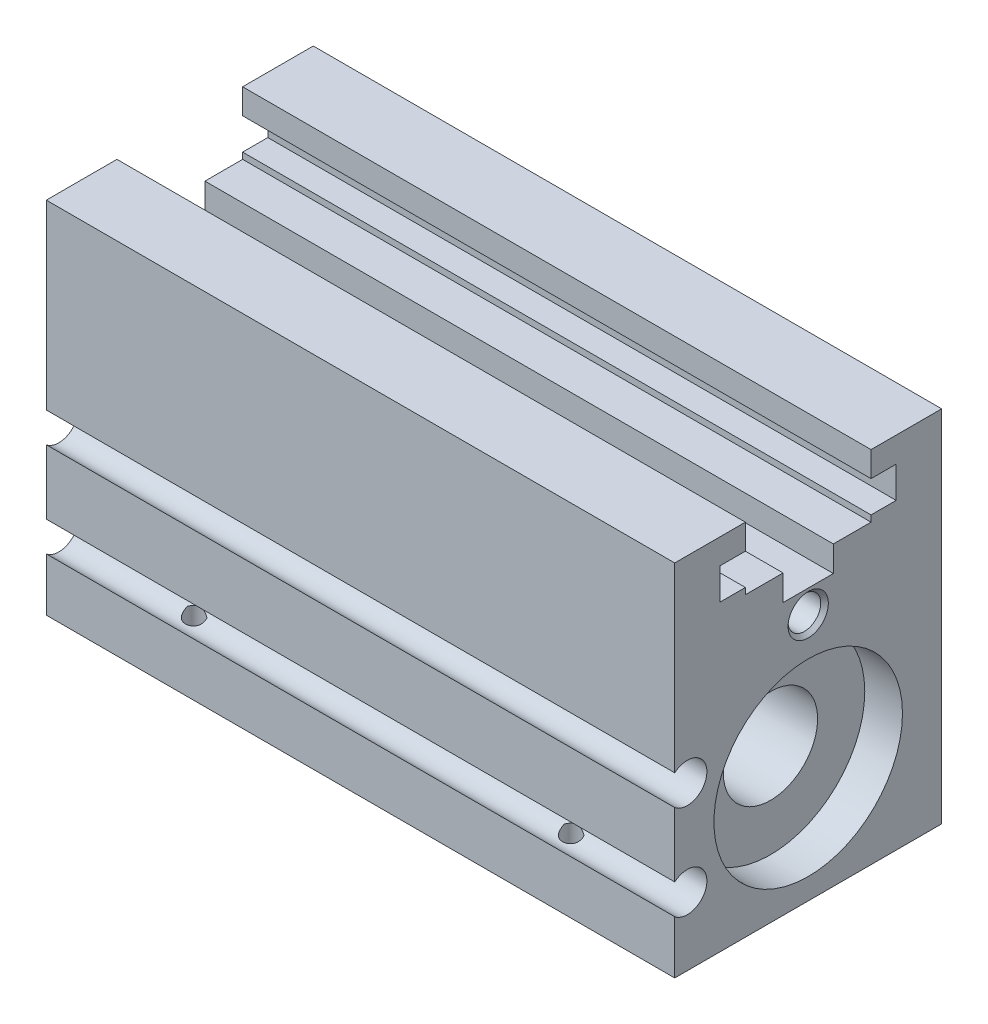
ISO-10303-21;
HEADER;
FILE_DESCRIPTION(('STEP AP214'),'2;1');
FILE_NAME('part.step','',(''),(''),'','','');
FILE_SCHEMA(('AUTOMOTIVE_DESIGN { 1 0 10303 214 1 1 1 1 }'));
ENDSEC;
DATA;
#1=APPLICATION_CONTEXT('core data for automotive mechanical design processes');
#2=APPLICATION_PROTOCOL_DEFINITION('international standard','automotive_design',2000,#1);
#3=PRODUCT_CONTEXT('',#1,'mechanical');
#4=PRODUCT('Part','Part','',(#3));
#5=PRODUCT_RELATED_PRODUCT_CATEGORY('part','',(#4));
#6=PRODUCT_DEFINITION_FORMATION('','',#4);
#7=PRODUCT_DEFINITION_CONTEXT('part definition',#1,'design');
#8=PRODUCT_DEFINITION('design','',#6,#7);
#9=PRODUCT_DEFINITION_SHAPE('','',#8);
#10=(LENGTH_UNIT() NAMED_UNIT(*) SI_UNIT(.MILLI.,.METRE.));
#11=(NAMED_UNIT(*) PLANE_ANGLE_UNIT() SI_UNIT($,.RADIAN.));
#12=(NAMED_UNIT(*) SI_UNIT($,.STERADIAN.) SOLID_ANGLE_UNIT());
#13=UNCERTAINTY_MEASURE_WITH_UNIT(LENGTH_MEASURE(1.E-05),#10,'distance_accuracy_value','');
#14=(GEOMETRIC_REPRESENTATION_CONTEXT(3) GLOBAL_UNCERTAINTY_ASSIGNED_CONTEXT((#13)) GLOBAL_UNIT_ASSIGNED_CONTEXT((#10,
#11,#12)) REPRESENTATION_CONTEXT('',''));
#15=CARTESIAN_POINT('',(0.,0.,0.));
#16=DIRECTION('',(0.,0.,1.));
#17=DIRECTION('',(1.,0.,0.));
#18=AXIS2_PLACEMENT_3D('',#15,#16,#17);
#19=CARTESIAN_POINT('',(63.5,-1.72719999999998,12.2174));
#20=DIRECTION('',(-1.,0.,0.));
#21=DIRECTION('',(0.,0.,1.));
#22=AXIS2_PLACEMENT_3D('',#19,#20,#21);
#23=PLANE('',#22);
#24=DIRECTION('',(0.,-1.,0.));
#25=VECTOR('',#24,1.);
#26=CARTESIAN_POINT('',(63.5,-12.798209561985,13.4874));
#27=LINE('',#26,#25);
#28=CARTESIAN_POINT('',(63.5,-12.798209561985,13.4874));
#29=VERTEX_POINT('',#28);
#30=CARTESIAN_POINT('',(63.5,-18.161,13.4874));
#31=VERTEX_POINT('',#30);
#32=EDGE_CURVE('E415',#29,#31,#27,.T.);
#33=ORIENTED_EDGE('',*,*,#32,.T.);
#34=DIRECTION('',(0.,0.,-1.));
#35=VECTOR('',#34,1.);
#36=CARTESIAN_POINT('',(63.5,-18.161,13.4874));
#37=LINE('',#36,#35);
#38=CARTESIAN_POINT('',(63.5,-18.161,-13.4874));
#39=VERTEX_POINT('',#38);
#40=EDGE_CURVE('E417',#31,#39,#37,.T.);
#41=ORIENTED_EDGE('',*,*,#40,.T.);
#42=DIRECTION('',(0.,1.,0.));
#43=VECTOR('',#42,1.);
#44=CARTESIAN_POINT('',(63.5,-18.161,-13.4874));
#45=LINE('',#44,#43);
#46=CARTESIAN_POINT('',(63.5,18.161,-13.4874));
#47=VERTEX_POINT('',#46);
#48=EDGE_CURVE('E420',#39,#47,#45,.T.);
#49=ORIENTED_EDGE('',*,*,#48,.T.);
#50=DIRECTION('',(0.,0.,1.));
#51=VECTOR('',#50,1.);
#52=CARTESIAN_POINT('',(63.5,18.161,-13.4874));
#53=LINE('',#52,#51);
#54=CARTESIAN_POINT('',(63.5,18.161,-6.35));
#55=VERTEX_POINT('',#54);
#56=EDGE_CURVE('E422',#47,#55,#53,.T.);
#57=ORIENTED_EDGE('',*,*,#56,.T.);
#58=DIRECTION('',(0.,-1.,0.));
#59=VECTOR('',#58,1.);
#60=CARTESIAN_POINT('',(63.5,18.161,-6.35));
#61=LINE('',#60,#59);
#62=CARTESIAN_POINT('',(63.5,15.621,-6.35));
#63=VERTEX_POINT('',#62);
#64=EDGE_CURVE('E424',#55,#63,#61,.T.);
#65=ORIENTED_EDGE('',*,*,#64,.T.);
#66=DIRECTION('',(0.,0.,-1.));
#67=VECTOR('',#66,1.);
#68=CARTESIAN_POINT('',(63.5,15.621,-6.35));
#69=LINE('',#68,#67);
#70=CARTESIAN_POINT('',(63.5,15.621,-8.89));
#71=VERTEX_POINT('',#70);
#72=EDGE_CURVE('E426',#63,#71,#69,.T.);
#73=ORIENTED_EDGE('',*,*,#72,.T.);
#74=DIRECTION('',(0.,-1.,0.));
#75=VECTOR('',#74,1.);
#76=CARTESIAN_POINT('',(63.5,15.621,-8.89));
#77=LINE('',#76,#75);
#78=CARTESIAN_POINT('',(63.5,12.446,-8.89));
#79=VERTEX_POINT('',#78);
#80=EDGE_CURVE('E428',#71,#79,#77,.T.);
#81=ORIENTED_EDGE('',*,*,#80,.T.);
#82=DIRECTION('',(0.,0.,1.));
#83=VECTOR('',#82,1.);
#84=CARTESIAN_POINT('',(63.5,12.446,-8.89));
#85=LINE('',#84,#83);
#86=CARTESIAN_POINT('',(63.5,12.446,-6.35));
#87=VERTEX_POINT('',#86);
#88=EDGE_CURVE('E430',#79,#87,#85,.T.);
#89=ORIENTED_EDGE('',*,*,#88,.T.);
#90=DIRECTION('',(0.,-1.,0.));
#91=VECTOR('',#90,1.);
#92=CARTESIAN_POINT('',(63.5,12.446,-6.35));
#93=LINE('',#92,#91);
#94=CARTESIAN_POINT('',(63.5,11.811,-6.35));
#95=VERTEX_POINT('',#94);
#96=EDGE_CURVE('E432',#87,#95,#93,.T.);
#97=ORIENTED_EDGE('',*,*,#96,.T.);
#98=DIRECTION('',(0.,0.,1.));
#99=VECTOR('',#98,1.);
#100=CARTESIAN_POINT('',(63.5,11.811,-6.35));
#101=LINE('',#100,#99);
#102=CARTESIAN_POINT('',(63.5,11.811,-2.54));
#103=VERTEX_POINT('',#102);
#104=EDGE_CURVE('E434',#95,#103,#101,.T.);
#105=ORIENTED_EDGE('',*,*,#104,.T.);
#106=DIRECTION('',(0.,-1.,0.));
#107=VECTOR('',#106,1.);
#108=CARTESIAN_POINT('',(63.5,11.811,-2.54));
#109=LINE('',#108,#107);
#110=CARTESIAN_POINT('',(63.5,9.2202,-2.54));
#111=VERTEX_POINT('',#110);
#112=EDGE_CURVE('E436',#103,#111,#109,.T.);
#113=ORIENTED_EDGE('',*,*,#112,.T.);
#114=DIRECTION('',(0.,0.,1.));
#115=VECTOR('',#114,1.);
#116=CARTESIAN_POINT('',(63.5,9.2202,-2.54));
#117=LINE('',#116,#115);
#118=CARTESIAN_POINT('',(63.5,9.2202,2.54));
#119=VERTEX_POINT('',#118);
#120=EDGE_CURVE('E438',#111,#119,#117,.T.);
#121=ORIENTED_EDGE('',*,*,#120,.T.);
#122=DIRECTION('',(0.,1.,0.));
#123=VECTOR('',#122,1.);
#124=CARTESIAN_POINT('',(63.5,9.2202,2.54));
#125=LINE('',#124,#123);
#126=CARTESIAN_POINT('',(63.5,11.811,2.54));
#127=VERTEX_POINT('',#126);
#128=EDGE_CURVE('E440',#119,#127,#125,.T.);
#129=ORIENTED_EDGE('',*,*,#128,.T.);
#130=DIRECTION('',(0.,0.,1.));
#131=VECTOR('',#130,1.);
#132=CARTESIAN_POINT('',(63.5,11.811,2.54));
#133=LINE('',#132,#131);
#134=CARTESIAN_POINT('',(63.5,11.811,6.35));
#135=VERTEX_POINT('',#134);
#136=EDGE_CURVE('E442',#127,#135,#133,.T.);
#137=ORIENTED_EDGE('',*,*,#136,.T.);
#138=DIRECTION('',(0.,1.,0.));
#139=VECTOR('',#138,1.);
#140=CARTESIAN_POINT('',(63.5,11.811,6.35));
#141=LINE('',#140,#139);
#142=CARTESIAN_POINT('',(63.5,12.446,6.35));
#143=VERTEX_POINT('',#142);
#144=EDGE_CURVE('E444',#135,#143,#141,.T.);
#145=ORIENTED_EDGE('',*,*,#144,.T.);
#146=DIRECTION('',(0.,0.,1.));
#147=VECTOR('',#146,1.);
#148=CARTESIAN_POINT('',(63.5,12.446,6.35));
#149=LINE('',#148,#147);
#150=CARTESIAN_POINT('',(63.5,12.446,8.89));
#151=VERTEX_POINT('',#150);
#152=EDGE_CURVE('E446',#143,#151,#149,.T.);
#153=ORIENTED_EDGE('',*,*,#152,.T.);
#154=DIRECTION('',(0.,1.,0.));
#155=VECTOR('',#154,1.);
#156=CARTESIAN_POINT('',(63.5,12.446,8.89));
#157=LINE('',#156,#155);
#158=CARTESIAN_POINT('',(63.5,15.621,8.89));
#159=VERTEX_POINT('',#158);
#160=EDGE_CURVE('E448',#151,#159,#157,.T.);
#161=ORIENTED_EDGE('',*,*,#160,.T.);
#162=DIRECTION('',(0.,0.,-1.));
#163=VECTOR('',#162,1.);
#164=CARTESIAN_POINT('',(63.5,15.621,8.89));
#165=LINE('',#164,#163);
#166=CARTESIAN_POINT('',(63.5,15.621,6.35));
#167=VERTEX_POINT('',#166);
#168=EDGE_CURVE('E450',#159,#167,#165,.T.);
#169=ORIENTED_EDGE('',*,*,#168,.T.);
#170=DIRECTION('',(0.,1.,0.));
#171=VECTOR('',#170,1.);
#172=CARTESIAN_POINT('',(63.5,15.621,6.35));
#173=LINE('',#172,#171);
#174=CARTESIAN_POINT('',(63.5,18.161,6.35));
#175=VERTEX_POINT('',#174);
#176=EDGE_CURVE('E452',#167,#175,#173,.T.);
#177=ORIENTED_EDGE('',*,*,#176,.T.);
#178=DIRECTION('',(0.,0.,1.));
#179=VECTOR('',#178,1.);
#180=CARTESIAN_POINT('',(63.5,18.161,6.35));
#181=LINE('',#180,#179);
#182=CARTESIAN_POINT('',(63.5,18.161,13.4874));
#183=VERTEX_POINT('',#182);
#184=EDGE_CURVE('E454',#175,#183,#181,.T.);
#185=ORIENTED_EDGE('',*,*,#184,.T.);
#186=DIRECTION('',(0.,-1.,0.));
#187=VECTOR('',#186,1.);
#188=CARTESIAN_POINT('',(63.5,18.161,13.4874));
#189=LINE('',#188,#187);
#190=CARTESIAN_POINT('',(63.5,-0.20659043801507,13.4874));
#191=VERTEX_POINT('',#190);
#192=EDGE_CURVE('E456',#183,#191,#189,.T.);
#193=ORIENTED_EDGE('',*,*,#192,.T.);
#194=CARTESIAN_POINT('',(63.5,-1.72719999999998,12.2174));
#195=DIRECTION('',(-1.,0.,0.));
#196=DIRECTION('',(0.,0.,1.));
#197=AXIS2_PLACEMENT_3D('',#194,#195,#196);
#198=CIRCLE('',#197,1.98119999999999);
#199=CARTESIAN_POINT('',(63.5,-3.2478095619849,13.4874));
#200=VERTEX_POINT('',#199);
#201=EDGE_CURVE('E458',#191,#200,#198,.T.);
#202=ORIENTED_EDGE('',*,*,#201,.T.);
#203=DIRECTION('',(0.,-1.,0.));
#204=VECTOR('',#203,1.);
#205=CARTESIAN_POINT('',(63.5,-3.2478095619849,13.4874));
#206=LINE('',#205,#204);
#207=CARTESIAN_POINT('',(63.5,-9.7569904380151,13.4874));
#208=VERTEX_POINT('',#207);
#209=EDGE_CURVE('E460',#200,#208,#206,.T.);
#210=ORIENTED_EDGE('',*,*,#209,.T.);
#211=CARTESIAN_POINT('',(63.5,-11.2776000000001,12.2174));
#212=DIRECTION('',(-1.,0.,0.));
#213=DIRECTION('',(0.,0.,1.));
#214=AXIS2_PLACEMENT_3D('',#211,#212,#213);
#215=CIRCLE('',#214,1.98120000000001);
#216=EDGE_CURVE('E462',#208,#29,#215,.T.);
#217=ORIENTED_EDGE('',*,*,#216,.T.);
#218=EDGE_LOOP('',(#33,#41,#49,#57,#65,#73,#81,#89,#97,#105,#113,#121,#129,#137,#145,#153,#161,
#169,#177,#185,#193,#202,#210,#217));
#219=FACE_BOUND('',#218,.T.);
#220=CARTESIAN_POINT('',(63.5,-6.5024,0.));
#221=DIRECTION('',(1.,0.,0.));
#222=DIRECTION('',(0.,0.,-1.));
#223=AXIS2_PLACEMENT_3D('',#220,#221,#222);
#224=CIRCLE('',#223,9.525);
#225=CARTESIAN_POINT('',(63.5,-6.5024,-9.525));
#226=VERTEX_POINT('',#225);
#227=EDGE_CURVE('E402',#226,#226,#224,.T.);
#228=ORIENTED_EDGE('',*,*,#227,.F.);
#229=EDGE_LOOP('',(#228));
#230=FACE_BOUND('',#229,.T.);
#231=CARTESIAN_POINT('',(63.5,6.8834,0.));
#232=DIRECTION('',(-1.,0.,0.));
#233=DIRECTION('',(0.,0.,1.));
#234=AXIS2_PLACEMENT_3D('',#231,#232,#233);
#235=CIRCLE('',#234,2.032);
#236=CARTESIAN_POINT('',(63.5,6.8834,2.032));
#237=VERTEX_POINT('',#236);
#238=EDGE_CURVE('E915',#237,#237,#235,.T.);
#239=ORIENTED_EDGE('',*,*,#238,.T.);
#240=EDGE_LOOP('',(#239));
#241=FACE_BOUND('',#240,.T.);
#242=ADVANCED_FACE('F33',(#219,#230,#241),#23,.F.);
#243=CARTESIAN_POINT('',(59.69,-6.5024,0.));
#244=DIRECTION('',(1.,0.,0.));
#245=DIRECTION('',(0.,0.,-1.));
#246=AXIS2_PLACEMENT_3D('',#243,#244,#245);
#247=PLANE('',#246);
#248=CARTESIAN_POINT('',(59.69,-6.5024,0.));
#249=DIRECTION('',(1.,0.,0.));
#250=DIRECTION('',(0.,0.,-1.));
#251=AXIS2_PLACEMENT_3D('',#248,#249,#250);
#252=CIRCLE('',#251,9.525);
#253=CARTESIAN_POINT('',(59.69,-6.5024,-9.525));
#254=VERTEX_POINT('',#253);
#255=EDGE_CURVE('E409',#254,#254,#252,.T.);
#256=ORIENTED_EDGE('',*,*,#255,.T.);
#257=EDGE_LOOP('',(#256));
#258=FACE_BOUND('',#257,.T.);
#259=CARTESIAN_POINT('',(59.69,-6.5024,0.));
#260=DIRECTION('',(-1.,0.,0.));
#261=DIRECTION('',(0.,0.,1.));
#262=AXIS2_PLACEMENT_3D('',#259,#260,#261);
#263=CIRCLE('',#262,4.7625);
#264=CARTESIAN_POINT('',(59.69,-6.5024,4.7625));
#265=VERTEX_POINT('',#264);
#266=EDGE_CURVE('E923',#265,#265,#263,.T.);
#267=ORIENTED_EDGE('',*,*,#266,.T.);
#268=EDGE_LOOP('',(#267));
#269=FACE_BOUND('',#268,.T.);
#270=ADVANCED_FACE('F238',(#258,#269),#247,.T.);
#271=CARTESIAN_POINT('',(0.,-1.72719999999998,12.2174));
#272=DIRECTION('',(-1.,0.,0.));
#273=DIRECTION('',(0.,0.,1.));
#274=AXIS2_PLACEMENT_3D('',#271,#272,#273);
#275=PLANE('',#274);
#276=CARTESIAN_POINT('',(0.,-6.5024,0.));
#277=DIRECTION('',(1.,0.,0.));
#278=DIRECTION('',(0.,0.,-1.));
#279=AXIS2_PLACEMENT_3D('',#276,#277,#278);
#280=CIRCLE('',#279,9.525);
#281=CARTESIAN_POINT('',(0.,-6.5024,-9.525));
#282=VERTEX_POINT('',#281);
#283=EDGE_CURVE('E619',#282,#282,#280,.T.);
#284=ORIENTED_EDGE('',*,*,#283,.T.);
#285=EDGE_LOOP('',(#284));
#286=FACE_BOUND('',#285,.T.);
#287=CARTESIAN_POINT('',(0.,8.4582,10.3251));
#288=DIRECTION('',(-1.,0.,0.));
#289=DIRECTION('',(0.,0.,1.));
#290=AXIS2_PLACEMENT_3D('',#287,#288,#289);
#291=CIRCLE('',#290,1.397);
#292=CARTESIAN_POINT('',(0.,8.4582,11.7221));
#293=VERTEX_POINT('',#292);
#294=EDGE_CURVE('E658',#293,#293,#291,.T.);
#295=ORIENTED_EDGE('',*,*,#294,.F.);
#296=EDGE_LOOP('',(#295));
#297=FACE_BOUND('',#296,.T.);
#298=CARTESIAN_POINT('',(0.,8.4582,-10.3251));
#299=DIRECTION('',(1.,0.,0.));
#300=DIRECTION('',(0.,0.,-1.));
#301=AXIS2_PLACEMENT_3D('',#298,#299,#300);
#302=CIRCLE('',#301,1.20269);
#303=CARTESIAN_POINT('',(0.,8.4582,-9.12241));
#304=VERTEX_POINT('',#303);
#305=EDGE_CURVE('E398',#304,#304,#302,.T.);
#306=ORIENTED_EDGE('',*,*,#305,.T.);
#307=EDGE_LOOP('',(#306));
#308=FACE_BOUND('',#307,.T.);
#309=DIRECTION('',(0.,-1.,0.));
#310=VECTOR('',#309,1.);
#311=CARTESIAN_POINT('',(0.,-12.798209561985,13.4874));
#312=LINE('',#311,#310);
#313=CARTESIAN_POINT('',(0.,-12.798209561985,13.4874));
#314=VERTEX_POINT('',#313);
#315=CARTESIAN_POINT('',(0.,-18.161,13.4874));
#316=VERTEX_POINT('',#315);
#317=EDGE_CURVE('E412',#314,#316,#312,.T.);
#318=ORIENTED_EDGE('',*,*,#317,.F.);
#319=CARTESIAN_POINT('',(0.,-11.2776000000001,12.2174));
#320=DIRECTION('',(-1.,0.,0.));
#321=DIRECTION('',(0.,0.,1.));
#322=AXIS2_PLACEMENT_3D('',#319,#320,#321);
#323=CIRCLE('',#322,1.98120000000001);
#324=CARTESIAN_POINT('',(0.,-9.7569904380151,13.4874));
#325=VERTEX_POINT('',#324);
#326=EDGE_CURVE('E418',#325,#314,#323,.T.);
#327=ORIENTED_EDGE('',*,*,#326,.F.);
#328=DIRECTION('',(0.,-1.,0.));
#329=VECTOR('',#328,1.);
#330=CARTESIAN_POINT('',(0.,-3.2478095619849,13.4874));
#331=LINE('',#330,#329);
#332=CARTESIAN_POINT('',(0.,-3.2478095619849,13.4874));
#333=VERTEX_POINT('',#332);
#334=EDGE_CURVE('E509',#333,#325,#331,.T.);
#335=ORIENTED_EDGE('',*,*,#334,.F.);
#336=CARTESIAN_POINT('',(0.,-1.72719999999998,12.2174));
#337=DIRECTION('',(-1.,0.,0.));
#338=DIRECTION('',(0.,0.,1.));
#339=AXIS2_PLACEMENT_3D('',#336,#337,#338);
#340=CIRCLE('',#339,1.98119999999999);
#341=CARTESIAN_POINT('',(0.,-0.20659043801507,13.4874));
#342=VERTEX_POINT('',#341);
#343=EDGE_CURVE('E507',#342,#333,#340,.T.);
#344=ORIENTED_EDGE('',*,*,#343,.F.);
#345=DIRECTION('',(0.,-1.,0.));
#346=VECTOR('',#345,1.);
#347=CARTESIAN_POINT('',(0.,18.161,13.4874));
#348=LINE('',#347,#346);
#349=CARTESIAN_POINT('',(0.,18.161,13.4874));
#350=VERTEX_POINT('',#349);
#351=EDGE_CURVE('E505',#350,#342,#348,.T.);
#352=ORIENTED_EDGE('',*,*,#351,.F.);
#353=DIRECTION('',(0.,0.,1.));
#354=VECTOR('',#353,1.);
#355=CARTESIAN_POINT('',(0.,18.161,6.35));
#356=LINE('',#355,#354);
#357=CARTESIAN_POINT('',(0.,18.161,6.35));
#358=VERTEX_POINT('',#357);
#359=EDGE_CURVE('E503',#358,#350,#356,.T.);
#360=ORIENTED_EDGE('',*,*,#359,.F.);
#361=DIRECTION('',(0.,1.,0.));
#362=VECTOR('',#361,1.);
#363=CARTESIAN_POINT('',(0.,15.621,6.35));
#364=LINE('',#363,#362);
#365=CARTESIAN_POINT('',(0.,15.621,6.35));
#366=VERTEX_POINT('',#365);
#367=EDGE_CURVE('E501',#366,#358,#364,.T.);
#368=ORIENTED_EDGE('',*,*,#367,.F.);
#369=DIRECTION('',(0.,0.,-1.));
#370=VECTOR('',#369,1.);
#371=CARTESIAN_POINT('',(0.,15.621,8.89));
#372=LINE('',#371,#370);
#373=CARTESIAN_POINT('',(0.,15.621,8.89));
#374=VERTEX_POINT('',#373);
#375=EDGE_CURVE('E499',#374,#366,#372,.T.);
#376=ORIENTED_EDGE('',*,*,#375,.F.);
#377=DIRECTION('',(0.,1.,0.));
#378=VECTOR('',#377,1.);
#379=CARTESIAN_POINT('',(0.,12.446,8.89));
#380=LINE('',#379,#378);
#381=CARTESIAN_POINT('',(0.,12.446,8.89));
#382=VERTEX_POINT('',#381);
#383=EDGE_CURVE('E497',#382,#374,#380,.T.);
#384=ORIENTED_EDGE('',*,*,#383,.F.);
#385=DIRECTION('',(0.,0.,1.));
#386=VECTOR('',#385,1.);
#387=CARTESIAN_POINT('',(0.,12.446,6.35));
#388=LINE('',#387,#386);
#389=CARTESIAN_POINT('',(0.,12.446,6.35));
#390=VERTEX_POINT('',#389);
#391=EDGE_CURVE('E495',#390,#382,#388,.T.);
#392=ORIENTED_EDGE('',*,*,#391,.F.);
#393=DIRECTION('',(0.,1.,0.));
#394=VECTOR('',#393,1.);
#395=CARTESIAN_POINT('',(0.,11.811,6.35));
#396=LINE('',#395,#394);
#397=CARTESIAN_POINT('',(0.,11.811,6.35));
#398=VERTEX_POINT('',#397);
#399=EDGE_CURVE('E493',#398,#390,#396,.T.);
#400=ORIENTED_EDGE('',*,*,#399,.F.);
#401=DIRECTION('',(0.,0.,1.));
#402=VECTOR('',#401,1.);
#403=CARTESIAN_POINT('',(0.,11.811,2.54));
#404=LINE('',#403,#402);
#405=CARTESIAN_POINT('',(0.,11.811,2.54));
#406=VERTEX_POINT('',#405);
#407=EDGE_CURVE('E491',#406,#398,#404,.T.);
#408=ORIENTED_EDGE('',*,*,#407,.F.);
#409=DIRECTION('',(0.,1.,0.));
#410=VECTOR('',#409,1.);
#411=CARTESIAN_POINT('',(0.,9.2202,2.54));
#412=LINE('',#411,#410);
#413=CARTESIAN_POINT('',(0.,9.2202,2.54));
#414=VERTEX_POINT('',#413);
#415=EDGE_CURVE('E489',#414,#406,#412,.T.);
#416=ORIENTED_EDGE('',*,*,#415,.F.);
#417=DIRECTION('',(0.,0.,1.));
#418=VECTOR('',#417,1.);
#419=CARTESIAN_POINT('',(0.,9.2202,-2.54));
#420=LINE('',#419,#418);
#421=CARTESIAN_POINT('',(0.,9.2202,-2.54));
#422=VERTEX_POINT('',#421);
#423=EDGE_CURVE('E487',#422,#414,#420,.T.);
#424=ORIENTED_EDGE('',*,*,#423,.F.);
#425=DIRECTION('',(0.,-1.,0.));
#426=VECTOR('',#425,1.);
#427=CARTESIAN_POINT('',(0.,11.811,-2.54));
#428=LINE('',#427,#426);
#429=CARTESIAN_POINT('',(0.,11.811,-2.54));
#430=VERTEX_POINT('',#429);
#431=EDGE_CURVE('E485',#430,#422,#428,.T.);
#432=ORIENTED_EDGE('',*,*,#431,.F.);
#433=DIRECTION('',(0.,0.,1.));
#434=VECTOR('',#433,1.);
#435=CARTESIAN_POINT('',(0.,11.811,-6.35));
#436=LINE('',#435,#434);
#437=CARTESIAN_POINT('',(0.,11.811,-6.35));
#438=VERTEX_POINT('',#437);
#439=EDGE_CURVE('E483',#438,#430,#436,.T.);
#440=ORIENTED_EDGE('',*,*,#439,.F.);
#441=DIRECTION('',(0.,-1.,0.));
#442=VECTOR('',#441,1.);
#443=CARTESIAN_POINT('',(0.,12.446,-6.35));
#444=LINE('',#443,#442);
#445=CARTESIAN_POINT('',(0.,12.446,-6.35));
#446=VERTEX_POINT('',#445);
#447=EDGE_CURVE('E481',#446,#438,#444,.T.);
#448=ORIENTED_EDGE('',*,*,#447,.F.);
#449=DIRECTION('',(0.,0.,1.));
#450=VECTOR('',#449,1.);
#451=CARTESIAN_POINT('',(0.,12.446,-8.89));
#452=LINE('',#451,#450);
#453=CARTESIAN_POINT('',(0.,12.446,-8.89));
#454=VERTEX_POINT('',#453);
#455=EDGE_CURVE('E479',#454,#446,#452,.T.);
#456=ORIENTED_EDGE('',*,*,#455,.F.);
#457=DIRECTION('',(0.,-1.,0.));
#458=VECTOR('',#457,1.);
#459=CARTESIAN_POINT('',(0.,15.621,-8.89));
#460=LINE('',#459,#458);
#461=CARTESIAN_POINT('',(0.,15.621,-8.89));
#462=VERTEX_POINT('',#461);
#463=EDGE_CURVE('E477',#462,#454,#460,.T.);
#464=ORIENTED_EDGE('',*,*,#463,.F.);
#465=DIRECTION('',(0.,0.,-1.));
#466=VECTOR('',#465,1.);
#467=CARTESIAN_POINT('',(0.,15.621,-6.35));
#468=LINE('',#467,#466);
#469=CARTESIAN_POINT('',(0.,15.621,-6.35));
#470=VERTEX_POINT('',#469);
#471=EDGE_CURVE('E475',#470,#462,#468,.T.);
#472=ORIENTED_EDGE('',*,*,#471,.F.);
#473=DIRECTION('',(0.,-1.,0.));
#474=VECTOR('',#473,1.);
#475=CARTESIAN_POINT('',(0.,18.161,-6.35));
#476=LINE('',#475,#474);
#477=CARTESIAN_POINT('',(0.,18.161,-6.35));
#478=VERTEX_POINT('',#477);
#479=EDGE_CURVE('E473',#478,#470,#476,.T.);
#480=ORIENTED_EDGE('',*,*,#479,.F.);
#481=DIRECTION('',(0.,0.,1.));
#482=VECTOR('',#481,1.);
#483=CARTESIAN_POINT('',(0.,18.161,-13.4874));
#484=LINE('',#483,#482);
#485=CARTESIAN_POINT('',(0.,18.161,-13.4874));
#486=VERTEX_POINT('',#485);
#487=EDGE_CURVE('E471',#486,#478,#484,.T.);
#488=ORIENTED_EDGE('',*,*,#487,.F.);
#489=DIRECTION('',(0.,1.,0.));
#490=VECTOR('',#489,1.);
#491=CARTESIAN_POINT('',(0.,-18.161,-13.4874));
#492=LINE('',#491,#490);
#493=CARTESIAN_POINT('',(0.,-18.161,-13.4874));
#494=VERTEX_POINT('',#493);
#495=EDGE_CURVE('E469',#494,#486,#492,.T.);
#496=ORIENTED_EDGE('',*,*,#495,.F.);
#497=DIRECTION('',(0.,0.,-1.));
#498=VECTOR('',#497,1.);
#499=CARTESIAN_POINT('',(0.,-18.161,13.4874));
#500=LINE('',#499,#498);
#501=EDGE_CURVE('E467',#316,#494,#500,.T.);
#502=ORIENTED_EDGE('',*,*,#501,.F.);
#503=EDGE_LOOP('',(#318,#327,#335,#344,#352,#360,#368,#376,#384,#392,#400,#408,#416,#424,#432,
#440,#448,#456,#464,#472,#480,#488,#496,#502));
#504=FACE_BOUND('',#503,.T.);
#505=CARTESIAN_POINT('',(0.,-15.367,10.3251));
#506=DIRECTION('',(1.,0.,0.));
#507=DIRECTION('',(0.,0.,-1.));
#508=AXIS2_PLACEMENT_3D('',#505,#506,#507);
#509=CIRCLE('',#508,1.20269);
#510=CARTESIAN_POINT('',(0.,-15.367,11.52779));
#511=VERTEX_POINT('',#510);
#512=EDGE_CURVE('E405',#511,#511,#509,.T.);
#513=ORIENTED_EDGE('',*,*,#512,.T.);
#514=EDGE_LOOP('',(#513));
#515=FACE_BOUND('',#514,.T.);
#516=CARTESIAN_POINT('',(0.,-15.367,-10.3251));
#517=DIRECTION('',(-1.,0.,0.));
#518=DIRECTION('',(0.,0.,1.));
#519=AXIS2_PLACEMENT_3D('',#516,#517,#518);
#520=CIRCLE('',#519,1.397);
#521=CARTESIAN_POINT('',(0.,-15.367,-8.9281));
#522=VERTEX_POINT('',#521);
#523=EDGE_CURVE('E649',#522,#522,#520,.T.);
#524=ORIENTED_EDGE('',*,*,#523,.F.);
#525=EDGE_LOOP('',(#524));
#526=FACE_BOUND('',#525,.T.);
#527=CARTESIAN_POINT('',(0.,5.360924,0.));
#528=DIRECTION('',(-1.,0.,0.));
#529=DIRECTION('',(0.,0.,1.));
#530=AXIS2_PLACEMENT_3D('',#527,#528,#529);
#531=CIRCLE('',#530,2.032);
#532=CARTESIAN_POINT('',(0.,5.360924,2.032));
#533=VERTEX_POINT('',#532);
#534=EDGE_CURVE('E669',#533,#533,#531,.T.);
#535=ORIENTED_EDGE('',*,*,#534,.F.);
#536=EDGE_LOOP('',(#535));
#537=FACE_BOUND('',#536,.T.);
#538=ADVANCED_FACE('F244',(#286,#297,#308,#504,#515,#526,#537),#275,.T.);
#539=CARTESIAN_POINT('',(63.5,-18.161,13.4874));
#540=DIRECTION('',(0.,1.,0.));
#541=DIRECTION('',(0.,0.,1.));
#542=AXIS2_PLACEMENT_3D('',#539,#540,#541);
#543=PLANE('',#542);
#544=CARTESIAN_POINT('',(44.45,-18.161,-11.1125));
#545=DIRECTION('',(0.,1.,0.));
#546=DIRECTION('',(0.,0.,1.));
#547=AXIS2_PLACEMENT_3D('',#544,#545,#546);
#548=CIRCLE('',#547,1.20269);
#549=CARTESIAN_POINT('',(44.45,-18.161,-9.90981));
#550=VERTEX_POINT('',#549);
#551=EDGE_CURVE('E683',#550,#550,#548,.T.);
#552=ORIENTED_EDGE('',*,*,#551,.T.);
#553=EDGE_LOOP('',(#552));
#554=FACE_BOUND('',#553,.T.);
#555=CARTESIAN_POINT('',(19.05,-18.161,11.1125));
#556=DIRECTION('',(0.,1.,0.));
#557=DIRECTION('',(0.,0.,1.));
#558=AXIS2_PLACEMENT_3D('',#555,#556,#557);
#559=CIRCLE('',#558,1.20269);
#560=CARTESIAN_POINT('',(19.05,-18.161,12.31519));
#561=VERTEX_POINT('',#560);
#562=EDGE_CURVE('E694',#561,#561,#559,.T.);
#563=ORIENTED_EDGE('',*,*,#562,.T.);
#564=EDGE_LOOP('',(#563));
#565=FACE_BOUND('',#564,.T.);
#566=CARTESIAN_POINT('',(50.8,-18.161,-11.1125));
#567=DIRECTION('',(0.,-1.,0.));
#568=DIRECTION('',(0.,0.,-1.));
#569=AXIS2_PLACEMENT_3D('',#566,#567,#568);
#570=CIRCLE('',#569,1.397);
#571=CARTESIAN_POINT('',(50.8,-18.1610000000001,-12.5095));
#572=VERTEX_POINT('',#571);
#573=EDGE_CURVE('E597',#572,#572,#570,.T.);
#574=ORIENTED_EDGE('',*,*,#573,.F.);
#575=EDGE_LOOP('',(#574));
#576=FACE_BOUND('',#575,.T.);
#577=CARTESIAN_POINT('',(12.7,-18.161,11.1125));
#578=DIRECTION('',(0.,-1.,0.));
#579=DIRECTION('',(0.,0.,-1.));
#580=AXIS2_PLACEMENT_3D('',#577,#578,#579);
#581=CIRCLE('',#580,1.397);
#582=CARTESIAN_POINT('',(12.7,-18.1610000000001,9.7155));
#583=VERTEX_POINT('',#582);
#584=EDGE_CURVE('E613',#583,#583,#581,.T.);
#585=ORIENTED_EDGE('',*,*,#584,.F.);
#586=EDGE_LOOP('',(#585));
#587=FACE_BOUND('',#586,.T.);
#588=ORIENTED_EDGE('',*,*,#501,.T.);
#589=DIRECTION('',(-1.,0.,0.));
#590=VECTOR('',#589,1.);
#591=CARTESIAN_POINT('',(63.5,-18.161,-13.4874));
#592=LINE('',#591,#590);
#593=EDGE_CURVE('E577',#39,#494,#592,.T.);
#594=ORIENTED_EDGE('',*,*,#593,.F.);
#595=ORIENTED_EDGE('',*,*,#40,.F.);
#596=DIRECTION('',(-1.,0.,0.));
#597=VECTOR('',#596,1.);
#598=CARTESIAN_POINT('',(63.5,-18.161,13.4874));
#599=LINE('',#598,#597);
#600=EDGE_CURVE('E580',#31,#316,#599,.T.);
#601=ORIENTED_EDGE('',*,*,#600,.T.);
#602=EDGE_LOOP('',(#588,#594,#595,#601));
#603=FACE_BOUND('',#602,.T.);
#604=CARTESIAN_POINT('',(50.8,-18.161,11.1125));
#605=DIRECTION('',(0.,-1.,0.));
#606=DIRECTION('',(0.,0.,-1.));
#607=AXIS2_PLACEMENT_3D('',#604,#605,#606);
#608=CIRCLE('',#607,1.397);
#609=CARTESIAN_POINT('',(50.8,-18.1610000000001,9.7155));
#610=VERTEX_POINT('',#609);
#611=EDGE_CURVE('E600',#610,#610,#608,.T.);
#612=ORIENTED_EDGE('',*,*,#611,.F.);
#613=EDGE_LOOP('',(#612));
#614=FACE_BOUND('',#613,.T.);
#615=CARTESIAN_POINT('',(12.7,-18.161,-11.1125));
#616=DIRECTION('',(0.,-1.,0.));
#617=DIRECTION('',(0.,0.,-1.));
#618=AXIS2_PLACEMENT_3D('',#615,#616,#617);
#619=CIRCLE('',#618,1.397);
#620=CARTESIAN_POINT('',(12.7,-18.1610000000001,-12.5095));
#621=VERTEX_POINT('',#620);
#622=EDGE_CURVE('E707',#621,#621,#619,.T.);
#623=ORIENTED_EDGE('',*,*,#622,.F.);
#624=EDGE_LOOP('',(#623));
#625=FACE_BOUND('',#624,.T.);
#626=CARTESIAN_POINT('',(44.45,-18.161,11.1125));
#627=DIRECTION('',(0.,1.,0.));
#628=DIRECTION('',(0.,0.,1.));
#629=AXIS2_PLACEMENT_3D('',#626,#627,#628);
#630=CIRCLE('',#629,1.20269);
#631=CARTESIAN_POINT('',(44.45,-18.161,12.31519));
#632=VERTEX_POINT('',#631);
#633=EDGE_CURVE('E688',#632,#632,#630,.T.);
#634=ORIENTED_EDGE('',*,*,#633,.T.);
#635=EDGE_LOOP('',(#634));
#636=FACE_BOUND('',#635,.T.);
#637=CARTESIAN_POINT('',(19.05,-18.161,-11.1125));
#638=DIRECTION('',(0.,1.,0.));
#639=DIRECTION('',(0.,0.,1.));
#640=AXIS2_PLACEMENT_3D('',#637,#638,#639);
#641=CIRCLE('',#640,1.20269);
#642=CARTESIAN_POINT('',(19.05,-18.161,-9.90981));
#643=VERTEX_POINT('',#642);
#644=EDGE_CURVE('E671',#643,#643,#641,.T.);
#645=ORIENTED_EDGE('',*,*,#644,.T.);
#646=EDGE_LOOP('',(#645));
#647=FACE_BOUND('',#646,.T.);
#648=ADVANCED_FACE('F253',(#554,#565,#576,#587,#603,#614,#625,#636,#647),#543,.F.);
#649=CARTESIAN_POINT('',(63.5,-11.2776000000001,12.2174));
#650=DIRECTION('',(-1.,0.,0.));
#651=DIRECTION('',(0.,0.,1.));
#652=AXIS2_PLACEMENT_3D('',#649,#650,#651);
#653=CYLINDRICAL_SURFACE('',#652,1.98120000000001);
#654=CARTESIAN_POINT('',(11.6963841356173,-12.803987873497,10.9543507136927));
#655=CARTESIAN_POINT('',(11.6925312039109,-12.8242332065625,10.9788160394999));
#656=CARTESIAN_POINT('',(11.6895030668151,-12.8439491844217,11.0038430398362));
#657=CARTESIAN_POINT('',(11.6853061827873,-12.8822413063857,11.0549449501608));
#658=CARTESIAN_POINT('',(11.6841394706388,-12.9008161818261,11.0810209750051));
#659=CARTESIAN_POINT('',(11.6837557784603,-12.9548343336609,11.1609108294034));
#660=CARTESIAN_POINT('',(11.6877012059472,-12.9883519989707,11.216122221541));
#661=CARTESIAN_POINT('',(11.7056294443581,-13.0494752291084,11.3287249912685));
#662=CARTESIAN_POINT('',(11.7196819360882,-13.0770380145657,11.3861288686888));
#663=CARTESIAN_POINT('',(11.758822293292,-13.1253159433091,11.4998387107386));
#664=CARTESIAN_POINT('',(11.7838672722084,-13.1460571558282,11.5561480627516));
#665=CARTESIAN_POINT('',(11.8406038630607,-13.1785506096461,11.6570800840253));
#666=CARTESIAN_POINT('',(11.8708732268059,-13.1911549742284,11.7022349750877));
#667=CARTESIAN_POINT('',(11.9388687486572,-13.2121453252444,11.7877169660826));
#668=CARTESIAN_POINT('',(11.9766013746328,-13.2205276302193,11.8280398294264));
#669=CARTESIAN_POINT('',(12.0568054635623,-13.2336718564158,11.9007725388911));
#670=CARTESIAN_POINT('',(12.099029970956,-13.2385640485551,11.933432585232));
#671=CARTESIAN_POINT('',(12.1882009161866,-13.2461331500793,11.9917935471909));
#672=CARTESIAN_POINT('',(12.2351466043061,-13.2488104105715,12.0174955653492));
#673=CARTESIAN_POINT('',(12.3343879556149,-13.252832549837,12.062054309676));
#674=CARTESIAN_POINT('',(12.3868189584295,-13.2541230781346,12.0806146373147));
#675=CARTESIAN_POINT('',(12.4940225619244,-13.2558805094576,12.1089459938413));
#676=CARTESIAN_POINT('',(12.5487956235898,-13.2563472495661,12.1187152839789));
#677=CARTESIAN_POINT('',(12.6605953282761,-13.2568490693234,12.129325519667));
#678=CARTESIAN_POINT('',(12.7176440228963,-13.2568730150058,12.1299361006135));
#679=CARTESIAN_POINT('',(12.8310428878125,-13.2564874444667,12.1216166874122));
#680=CARTESIAN_POINT('',(12.8873930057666,-13.2560778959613,12.1126859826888));
#681=CARTESIAN_POINT('',(12.9979988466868,-13.2544504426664,12.0854888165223));
#682=CARTESIAN_POINT('',(13.0522463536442,-13.2532296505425,12.0671890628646));
#683=CARTESIAN_POINT('',(13.1568633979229,-13.2492493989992,12.0217759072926));
#684=CARTESIAN_POINT('',(13.2072330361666,-13.2464899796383,11.9946627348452));
#685=CARTESIAN_POINT('',(13.3021329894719,-13.2384948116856,11.9327858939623));
#686=CARTESIAN_POINT('',(13.3467146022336,-13.233283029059,11.8980979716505));
#687=CARTESIAN_POINT('',(13.4292400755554,-13.2193561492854,11.8221520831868));
#688=CARTESIAN_POINT('',(13.4671860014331,-13.2106421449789,11.7808961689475));
#689=CARTESIAN_POINT('',(13.5341061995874,-13.1891950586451,11.6950599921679));
#690=CARTESIAN_POINT('',(13.5633572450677,-13.1766201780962,11.6506558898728));
#691=CARTESIAN_POINT('',(13.6140864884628,-13.1468483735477,11.5590866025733));
#692=CARTESIAN_POINT('',(13.6355693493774,-13.1296542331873,11.5119230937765));
#693=CARTESIAN_POINT('',(13.6703733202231,-13.0909069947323,11.4176387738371));
#694=CARTESIAN_POINT('',(13.6838477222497,-13.0694470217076,11.3705356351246));
#695=CARTESIAN_POINT('',(13.7037426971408,-13.0221609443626,11.2769668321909));
#696=CARTESIAN_POINT('',(13.710151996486,-12.996327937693,11.2305023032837));
#697=CARTESIAN_POINT('',(13.7163038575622,-12.9438716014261,11.144582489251));
#698=CARTESIAN_POINT('',(13.716705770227,-12.9176521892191,11.1049206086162));
#699=CARTESIAN_POINT('',(13.7132006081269,-12.8626568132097,11.0278616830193));
#700=CARTESIAN_POINT('',(13.7093124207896,-12.8338925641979,10.9904554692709));
#701=CARTESIAN_POINT('',(13.7036158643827,-12.803987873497,10.9543507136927));
#702=B_SPLINE_CURVE_WITH_KNOTS('',3,(#654,#655,#656,#657,#658,#659,#660,#661,#662,#663,#664,
#665,#666,#667,#668,#669,#670,#671,#672,#673,#674,#675,#676,#677,#678,#679,#680,#681,#682,#683,
#684,#685,#686,#687,#688,#689,#690,#691,#692,#693,#694,#695,#696,#697,#698,#699,#700,#701),
.UNSPECIFIED.,.F.,.F.,(4,2,2,2,2,2,2,2,2,2,2,2,2,2,2,2,2,2,2,2,2,2,2,4),(0.,0.0959294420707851,
0.191963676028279,0.385059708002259,0.579499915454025,0.773188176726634,0.939748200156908,
1.10645320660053,1.26655395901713,1.42662932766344,1.59277234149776,1.75894820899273,
1.92929700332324,2.0996584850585,2.27062957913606,2.44159622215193,2.61092571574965,
2.7802024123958,2.94330429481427,3.10630810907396,3.26608196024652,3.42611038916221,
3.56842715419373,3.7101198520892),.UNSPECIFIED.);
#703=CARTESIAN_POINT('',(11.6963841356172,-12.803987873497,10.9543507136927));
#704=VERTEX_POINT('',#703);
#705=CARTESIAN_POINT('',(13.7036158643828,-12.803987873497,10.9543507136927));
#706=VERTEX_POINT('',#705);
#707=EDGE_CURVE('E274',#704,#706,#702,.T.);
#708=ORIENTED_EDGE('',*,*,#707,.F.);
#709=CARTESIAN_POINT('',(13.8148283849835,-12.8628466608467,11.0290623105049));
#710=CARTESIAN_POINT('',(13.790867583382,-12.8498036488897,11.0116648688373));
#711=CARTESIAN_POINT('',(13.7664779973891,-12.8367662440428,10.9948677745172));
#712=CARTESIAN_POINT('',(13.7169128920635,-12.810770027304,10.9624193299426));
#713=CARTESIAN_POINT('',(13.691737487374,-12.7978112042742,10.9467678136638));
#714=CARTESIAN_POINT('',(13.614978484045,-12.7590718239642,10.9013526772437));
#715=CARTESIAN_POINT('',(13.5623044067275,-12.7335061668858,10.8732305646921));
#716=CARTESIAN_POINT('',(13.4519697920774,-12.6825569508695,10.8200227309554));
#717=CARTESIAN_POINT('',(13.3941917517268,-12.6572314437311,10.7951262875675));
#718=CARTESIAN_POINT('',(13.275794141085,-12.6092273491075,10.7500907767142));
#719=CARTESIAN_POINT('',(13.2151789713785,-12.586544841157,10.7299446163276));
#720=CARTESIAN_POINT('',(13.1241526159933,-12.5568711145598,10.7045302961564));
#721=CARTESIAN_POINT('',(13.0949655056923,-12.5479856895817,10.6970752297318));
#722=CARTESIAN_POINT('',(13.0358954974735,-12.5315829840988,10.683518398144));
#723=CARTESIAN_POINT('',(13.0060127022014,-12.5240655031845,10.6774164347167));
#724=CARTESIAN_POINT('',(12.9459420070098,-12.5108488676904,10.666812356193));
#725=CARTESIAN_POINT('',(12.9157619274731,-12.5051292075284,10.662292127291));
#726=CARTESIAN_POINT('',(12.8548796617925,-12.495769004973,10.6549488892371));
#727=CARTESIAN_POINT('',(12.8241776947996,-12.4921276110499,10.6521251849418));
#728=CARTESIAN_POINT('',(12.7619557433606,-12.4871845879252,10.648301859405));
#729=CARTESIAN_POINT('',(12.7304306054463,-12.4859223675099,10.647332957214));
#730=CARTESIAN_POINT('',(12.6673862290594,-12.4859814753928,10.647378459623));
#731=CARTESIAN_POINT('',(12.6358669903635,-12.4873026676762,10.6483927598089));
#732=CARTESIAN_POINT('',(12.5730040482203,-12.4924106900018,10.6523445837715));
#733=CARTESIAN_POINT('',(12.5416619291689,-12.4962094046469,10.6552913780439));
#734=CARTESIAN_POINT('',(12.4795269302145,-12.5059578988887,10.6629456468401));
#735=CARTESIAN_POINT('',(12.4487343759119,-12.5119089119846,10.6676541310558));
#736=CARTESIAN_POINT('',(12.3746914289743,-12.5284997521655,10.680988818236));
#737=CARTESIAN_POINT('',(12.3317950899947,-12.5400548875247,10.6904288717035));
#738=CARTESIAN_POINT('',(12.2474392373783,-12.5656520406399,10.7119581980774));
#739=CARTESIAN_POINT('',(12.20598070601,-12.5796957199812,10.7240492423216));
#740=CARTESIAN_POINT('',(12.1242841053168,-12.6095116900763,10.7505786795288));
#741=CARTESIAN_POINT('',(12.0840510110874,-12.6252900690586,10.7650254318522));
#742=CARTESIAN_POINT('',(12.0049096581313,-12.6579650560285,10.7960437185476));
#743=CARTESIAN_POINT('',(11.9660009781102,-12.6748613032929,10.8126145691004));
#744=CARTESIAN_POINT('',(11.8668771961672,-12.7195693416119,10.8582037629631));
#745=CARTESIAN_POINT('',(11.807626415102,-12.7479430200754,10.8888004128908));
#746=CARTESIAN_POINT('',(11.7217322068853,-12.7909280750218,10.9385464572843));
#747=CARTESIAN_POINT('',(11.6937451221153,-12.8052465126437,10.9556647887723));
#748=CARTESIAN_POINT('',(11.6387218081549,-12.8339894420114,10.9912975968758));
#749=CARTESIAN_POINT('',(11.6116857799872,-12.8484139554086,11.009812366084));
#750=CARTESIAN_POINT('',(11.5851716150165,-12.8628466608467,11.0290623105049));
#751=B_SPLINE_CURVE_WITH_KNOTS('',3,(#709,#710,#711,#712,#713,#714,#715,#716,#717,#718,#719,
#720,#721,#722,#723,#724,#725,#726,#727,#728,#729,#730,#731,#732,#733,#734,#735,#736,#737,#738,
#739,#740,#741,#742,#743,#744,#745,#746,#747,#748,#749,#750),.UNSPECIFIED.,.F.,.F.,(4,2,2,2,2,2,
2,2,2,2,2,2,2,2,2,2,2,2,2,2,4),(0.,0.0970467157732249,0.194079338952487,0.388717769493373,
0.59196375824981,0.794904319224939,0.889075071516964,0.983232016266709,1.0762723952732,
1.16927462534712,1.26380425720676,1.35832891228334,1.45331036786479,1.54834634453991,
1.68436525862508,1.82047533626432,1.95707936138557,2.09363951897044,2.3107201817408,
2.41807457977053,2.52545153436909),.UNSPECIFIED.);
#752=EDGE_CURVE('E266',#706,#704,#751,.T.);
#753=ORIENTED_EDGE('',*,*,#752,.F.);
#754=EDGE_LOOP('',(#708,#753));
#755=FACE_BOUND('',#754,.T.);
#756=ORIENTED_EDGE('',*,*,#326,.T.);
#757=DIRECTION('',(-1.,0.,0.));
#758=VECTOR('',#757,1.);
#759=CARTESIAN_POINT('',(63.5,-12.798209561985,13.4874));
#760=LINE('',#759,#758);
#761=EDGE_CURVE('E464',#29,#314,#760,.T.);
#762=ORIENTED_EDGE('',*,*,#761,.F.);
#763=ORIENTED_EDGE('',*,*,#216,.F.);
#764=DIRECTION('',(-1.,0.,0.));
#765=VECTOR('',#764,1.);
#766=CARTESIAN_POINT('',(63.5,-9.7569904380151,13.4874));
#767=LINE('',#766,#765);
#768=EDGE_CURVE('E514',#208,#325,#767,.T.);
#769=ORIENTED_EDGE('',*,*,#768,.T.);
#770=EDGE_LOOP('',(#756,#762,#763,#769));
#771=FACE_BOUND('',#770,.T.);
#772=CARTESIAN_POINT('',(49.7963841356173,-12.803987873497,10.9543507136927));
#773=CARTESIAN_POINT('',(49.7925312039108,-12.8242332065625,10.9788160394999));
#774=CARTESIAN_POINT('',(49.7895030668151,-12.8439491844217,11.0038430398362));
#775=CARTESIAN_POINT('',(49.7853061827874,-12.8822413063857,11.0549449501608));
#776=CARTESIAN_POINT('',(49.7841394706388,-12.9008161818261,11.0810209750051));
#777=CARTESIAN_POINT('',(49.7837557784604,-12.9548343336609,11.1609108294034));
#778=CARTESIAN_POINT('',(49.7877012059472,-12.9883519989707,11.216122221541));
#779=CARTESIAN_POINT('',(49.8056294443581,-13.0494752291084,11.3287249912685));
#780=CARTESIAN_POINT('',(49.8196819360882,-13.0770380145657,11.3861288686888));
#781=CARTESIAN_POINT('',(49.858822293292,-13.1253159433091,11.4998387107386));
#782=CARTESIAN_POINT('',(49.8838672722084,-13.1460571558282,11.5561480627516));
#783=CARTESIAN_POINT('',(49.9406038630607,-13.1785506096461,11.6570800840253));
#784=CARTESIAN_POINT('',(49.9708732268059,-13.1911549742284,11.7022349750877));
#785=CARTESIAN_POINT('',(50.0388687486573,-13.2121453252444,11.7877169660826));
#786=CARTESIAN_POINT('',(50.0766013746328,-13.2205276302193,11.8280398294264));
#787=CARTESIAN_POINT('',(50.1568054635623,-13.2336718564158,11.9007725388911));
#788=CARTESIAN_POINT('',(50.199029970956,-13.2385640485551,11.933432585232));
#789=CARTESIAN_POINT('',(50.2882009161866,-13.2461331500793,11.9917935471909));
#790=CARTESIAN_POINT('',(50.335146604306,-13.2488104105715,12.0174955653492));
#791=CARTESIAN_POINT('',(50.4343879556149,-13.252832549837,12.062054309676));
#792=CARTESIAN_POINT('',(50.4868189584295,-13.2541230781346,12.0806146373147));
#793=CARTESIAN_POINT('',(50.5940225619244,-13.2558805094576,12.1089459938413));
#794=CARTESIAN_POINT('',(50.6487956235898,-13.2563472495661,12.1187152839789));
#795=CARTESIAN_POINT('',(50.7605953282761,-13.2568490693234,12.129325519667));
#796=CARTESIAN_POINT('',(50.8176440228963,-13.2568730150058,12.1299361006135));
#797=CARTESIAN_POINT('',(50.9310428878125,-13.2564874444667,12.1216166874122));
#798=CARTESIAN_POINT('',(50.9873930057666,-13.2560778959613,12.1126859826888));
#799=CARTESIAN_POINT('',(51.0979988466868,-13.2544504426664,12.0854888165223));
#800=CARTESIAN_POINT('',(51.1522463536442,-13.2532296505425,12.0671890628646));
#801=CARTESIAN_POINT('',(51.2568633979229,-13.2492493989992,12.0217759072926));
#802=CARTESIAN_POINT('',(51.3072330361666,-13.2464899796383,11.9946627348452));
#803=CARTESIAN_POINT('',(51.4021329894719,-13.2384948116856,11.9327858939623));
#804=CARTESIAN_POINT('',(51.4467146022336,-13.233283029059,11.8980979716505));
#805=CARTESIAN_POINT('',(51.5292400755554,-13.2193561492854,11.8221520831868));
#806=CARTESIAN_POINT('',(51.5671860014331,-13.2106421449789,11.7808961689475));
#807=CARTESIAN_POINT('',(51.6341061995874,-13.1891950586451,11.6950599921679));
#808=CARTESIAN_POINT('',(51.6633572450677,-13.1766201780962,11.6506558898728));
#809=CARTESIAN_POINT('',(51.7140864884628,-13.1468483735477,11.5590866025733));
#810=CARTESIAN_POINT('',(51.7355693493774,-13.1296542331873,11.5119230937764));
#811=CARTESIAN_POINT('',(51.7703733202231,-13.0909069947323,11.4176387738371));
#812=CARTESIAN_POINT('',(51.7838477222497,-13.0694470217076,11.3705356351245));
#813=CARTESIAN_POINT('',(51.8037426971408,-13.0221609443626,11.2769668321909));
#814=CARTESIAN_POINT('',(51.810151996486,-12.996327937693,11.2305023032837));
#815=CARTESIAN_POINT('',(51.8163038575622,-12.9438716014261,11.144582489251));
#816=CARTESIAN_POINT('',(51.816705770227,-12.9176521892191,11.1049206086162));
#817=CARTESIAN_POINT('',(51.8132006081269,-12.8626568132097,11.0278616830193));
#818=CARTESIAN_POINT('',(51.8093124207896,-12.8338925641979,10.9904554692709));
#819=CARTESIAN_POINT('',(51.8036158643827,-12.803987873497,10.9543507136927));
#820=B_SPLINE_CURVE_WITH_KNOTS('',3,(#772,#773,#774,#775,#776,#777,#778,#779,#780,#781,#782,
#783,#784,#785,#786,#787,#788,#789,#790,#791,#792,#793,#794,#795,#796,#797,#798,#799,#800,#801,
#802,#803,#804,#805,#806,#807,#808,#809,#810,#811,#812,#813,#814,#815,#816,#817,#818,#819),
.UNSPECIFIED.,.F.,.F.,(4,2,2,2,2,2,2,2,2,2,2,2,2,2,2,2,2,2,2,2,2,2,2,4),(0.,0.0959294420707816,
0.191963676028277,0.385059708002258,0.579499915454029,0.773188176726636,0.939748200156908,
1.10645320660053,1.26655395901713,1.42662932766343,1.59277234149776,1.75894820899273,
1.92929700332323,2.09965848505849,2.27062957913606,2.44159622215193,2.61092571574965,
2.7802024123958,2.94330429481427,3.10630810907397,3.26608196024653,3.42611038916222,
3.56842715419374,3.71011985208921),.UNSPECIFIED.);
#821=CARTESIAN_POINT('',(49.7963841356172,-12.803987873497,10.9543507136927));
#822=VERTEX_POINT('',#821);
#823=CARTESIAN_POINT('',(51.8036158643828,-12.803987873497,10.9543507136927));
#824=VERTEX_POINT('',#823);
#825=EDGE_CURVE('E11',#822,#824,#820,.T.);
#826=ORIENTED_EDGE('',*,*,#825,.F.);
#827=CARTESIAN_POINT('',(51.9148283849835,-12.8628466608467,11.0290623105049));
#828=CARTESIAN_POINT('',(51.890867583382,-12.8498036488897,11.0116648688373));
#829=CARTESIAN_POINT('',(51.8664779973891,-12.8367662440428,10.9948677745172));
#830=CARTESIAN_POINT('',(51.8169128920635,-12.810770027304,10.9624193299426));
#831=CARTESIAN_POINT('',(51.791737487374,-12.7978112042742,10.9467678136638));
#832=CARTESIAN_POINT('',(51.714978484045,-12.7590718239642,10.9013526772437));
#833=CARTESIAN_POINT('',(51.6623044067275,-12.7335061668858,10.8732305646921));
#834=CARTESIAN_POINT('',(51.5519697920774,-12.6825569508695,10.8200227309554));
#835=CARTESIAN_POINT('',(51.4941917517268,-12.6572314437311,10.7951262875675));
#836=CARTESIAN_POINT('',(51.375794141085,-12.6092273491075,10.7500907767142));
#837=CARTESIAN_POINT('',(51.3151789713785,-12.586544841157,10.7299446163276));
#838=CARTESIAN_POINT('',(51.2241526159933,-12.5568711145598,10.7045302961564));
#839=CARTESIAN_POINT('',(51.1949655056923,-12.5479856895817,10.6970752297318));
#840=CARTESIAN_POINT('',(51.1358954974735,-12.5315829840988,10.683518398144));
#841=CARTESIAN_POINT('',(51.1060127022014,-12.5240655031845,10.6774164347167));
#842=CARTESIAN_POINT('',(51.0459420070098,-12.5108488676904,10.666812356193));
#843=CARTESIAN_POINT('',(51.0157619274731,-12.5051292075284,10.662292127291));
#844=CARTESIAN_POINT('',(50.9548796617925,-12.495769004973,10.6549488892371));
#845=CARTESIAN_POINT('',(50.9241776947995,-12.4921276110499,10.6521251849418));
#846=CARTESIAN_POINT('',(50.8619557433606,-12.4871845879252,10.648301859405));
#847=CARTESIAN_POINT('',(50.8304306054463,-12.4859223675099,10.647332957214));
#848=CARTESIAN_POINT('',(50.7673862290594,-12.4859814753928,10.647378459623));
#849=CARTESIAN_POINT('',(50.7358669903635,-12.4873026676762,10.6483927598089));
#850=CARTESIAN_POINT('',(50.6730040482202,-12.4924106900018,10.6523445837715));
#851=CARTESIAN_POINT('',(50.6416619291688,-12.4962094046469,10.6552913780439));
#852=CARTESIAN_POINT('',(50.5795269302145,-12.5059578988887,10.6629456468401));
#853=CARTESIAN_POINT('',(50.5487343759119,-12.5119089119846,10.6676541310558));
#854=CARTESIAN_POINT('',(50.4746914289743,-12.5284997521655,10.680988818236));
#855=CARTESIAN_POINT('',(50.4317950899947,-12.5400548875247,10.6904288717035));
#856=CARTESIAN_POINT('',(50.3474392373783,-12.5656520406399,10.7119581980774));
#857=CARTESIAN_POINT('',(50.30598070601,-12.5796957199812,10.7240492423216));
#858=CARTESIAN_POINT('',(50.2242841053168,-12.6095116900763,10.7505786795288));
#859=CARTESIAN_POINT('',(50.1840510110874,-12.6252900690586,10.7650254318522));
#860=CARTESIAN_POINT('',(50.1049096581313,-12.6579650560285,10.7960437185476));
#861=CARTESIAN_POINT('',(50.0660009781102,-12.6748613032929,10.8126145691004));
#862=CARTESIAN_POINT('',(49.9668771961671,-12.7195693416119,10.8582037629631));
#863=CARTESIAN_POINT('',(49.907626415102,-12.7479430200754,10.8888004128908));
#864=CARTESIAN_POINT('',(49.8217322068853,-12.7909280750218,10.9385464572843));
#865=CARTESIAN_POINT('',(49.7937451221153,-12.8052465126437,10.9556647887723));
#866=CARTESIAN_POINT('',(49.7387218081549,-12.8339894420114,10.9912975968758));
#867=CARTESIAN_POINT('',(49.7116857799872,-12.8484139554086,11.009812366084));
#868=CARTESIAN_POINT('',(49.6851716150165,-12.8628466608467,11.0290623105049));
#869=B_SPLINE_CURVE_WITH_KNOTS('',3,(#827,#828,#829,#830,#831,#832,#833,#834,#835,#836,#837,
#838,#839,#840,#841,#842,#843,#844,#845,#846,#847,#848,#849,#850,#851,#852,#853,#854,#855,#856,
#857,#858,#859,#860,#861,#862,#863,#864,#865,#866,#867,#868),.UNSPECIFIED.,.F.,.F.,(4,2,2,2,2,2,
2,2,2,2,2,2,2,2,2,2,2,2,2,2,4),(0.,0.0970467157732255,0.194079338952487,0.388717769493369,
0.591963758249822,0.794904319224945,0.889075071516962,0.983232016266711,1.0762723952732,
1.16927462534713,1.26380425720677,1.35832891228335,1.4533103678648,1.54834634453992,
1.68436525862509,1.82047533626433,1.95707936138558,2.09363951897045,2.31072018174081,
2.41807457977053,2.52545153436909),.UNSPECIFIED.);
#870=EDGE_CURVE('E46',#824,#822,#869,.T.);
#871=ORIENTED_EDGE('',*,*,#870,.F.);
#872=EDGE_LOOP('',(#826,#871));
#873=FACE_BOUND('',#872,.T.);
#874=ADVANCED_FACE('F255',(#755,#771,#873),#653,.F.);
#875=CARTESIAN_POINT('',(3.81,-6.5024,0.));
#876=DIRECTION('',(1.,0.,0.));
#877=DIRECTION('',(0.,0.,-1.));
#878=AXIS2_PLACEMENT_3D('',#875,#876,#877);
#879=PLANE('',#878);
#880=CARTESIAN_POINT('',(3.81,-6.5024,0.));
#881=DIRECTION('',(1.,0.,0.));
#882=DIRECTION('',(0.,0.,-1.));
#883=AXIS2_PLACEMENT_3D('',#880,#881,#882);
#884=CIRCLE('',#883,9.525);
#885=CARTESIAN_POINT('',(3.81,-6.5024,-9.525));
#886=VERTEX_POINT('',#885);
#887=EDGE_CURVE('E620',#886,#886,#884,.T.);
#888=ORIENTED_EDGE('',*,*,#887,.F.);
#889=EDGE_LOOP('',(#888));
#890=FACE_BOUND('',#889,.T.);
#891=CARTESIAN_POINT('',(3.81,-6.5024,0.));
#892=DIRECTION('',(1.,0.,0.));
#893=DIRECTION('',(0.,0.,-1.));
#894=AXIS2_PLACEMENT_3D('',#891,#892,#893);
#895=CIRCLE('',#894,9.3345);
#896=CARTESIAN_POINT('',(3.81,-6.5024,-9.3345));
#897=VERTEX_POINT('',#896);
#898=EDGE_CURVE('E582',#897,#897,#895,.F.);
#899=ORIENTED_EDGE('',*,*,#898,.F.);
#900=EDGE_LOOP('',(#899));
#901=FACE_BOUND('',#900,.T.);
#902=ADVANCED_FACE('F259',(#890,#901),#879,.F.);
#903=CARTESIAN_POINT('',(63.5,-18.161,-13.4874));
#904=DIRECTION('',(0.,0.,1.));
#905=DIRECTION('',(1.,0.,0.));
#906=AXIS2_PLACEMENT_3D('',#903,#904,#905);
#907=PLANE('',#906);
#908=CARTESIAN_POINT('',(5.715,3.8862,-13.4874));
#909=DIRECTION('',(0.,0.,1.));
#910=DIRECTION('',(1.,0.,0.));
#911=AXIS2_PLACEMENT_3D('',#908,#909,#910);
#912=CIRCLE('',#911,2.413);
#913=CARTESIAN_POINT('',(8.128,3.8862,-13.4874));
#914=VERTEX_POINT('',#913);
#915=EDGE_CURVE('E634',#914,#914,#912,.T.);
#916=ORIENTED_EDGE('',*,*,#915,.T.);
#917=EDGE_LOOP('',(#916));
#918=FACE_BOUND('',#917,.T.);
#919=ORIENTED_EDGE('',*,*,#495,.T.);
#920=DIRECTION('',(-1.,0.,0.));
#921=VECTOR('',#920,1.);
#922=CARTESIAN_POINT('',(63.5,18.161,-13.4874));
#923=LINE('',#922,#921);
#924=EDGE_CURVE('E574',#47,#486,#923,.T.);
#925=ORIENTED_EDGE('',*,*,#924,.F.);
#926=ORIENTED_EDGE('',*,*,#48,.F.);
#927=ORIENTED_EDGE('',*,*,#593,.T.);
#928=EDGE_LOOP('',(#919,#925,#926,#927));
#929=FACE_BOUND('',#928,.T.);
#930=CARTESIAN_POINT('',(54.61,3.8862,-13.4874));
#931=DIRECTION('',(0.,0.,1.));
#932=DIRECTION('',(1.,0.,0.));
#933=AXIS2_PLACEMENT_3D('',#930,#931,#932);
#934=CIRCLE('',#933,2.413);
#935=CARTESIAN_POINT('',(57.023,3.8862,-13.4874));
#936=VERTEX_POINT('',#935);
#937=EDGE_CURVE('E623',#936,#936,#934,.T.);
#938=ORIENTED_EDGE('',*,*,#937,.T.);
#939=EDGE_LOOP('',(#938));
#940=FACE_BOUND('',#939,.T.);
#941=ADVANCED_FACE('F320',(#918,#929,#940),#907,.F.);
#942=CARTESIAN_POINT('',(63.5,-12.798209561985,13.4874));
#943=DIRECTION('',(0.,0.,-1.));
#944=DIRECTION('',(-1.,0.,0.));
#945=AXIS2_PLACEMENT_3D('',#942,#943,#944);
#946=PLANE('',#945);
#947=ORIENTED_EDGE('',*,*,#317,.T.);
#948=ORIENTED_EDGE('',*,*,#600,.F.);
#949=ORIENTED_EDGE('',*,*,#32,.F.);
#950=ORIENTED_EDGE('',*,*,#761,.T.);
#951=EDGE_LOOP('',(#947,#948,#949,#950));
#952=FACE_BOUND('',#951,.T.);
#953=ADVANCED_FACE('F35',(#952),#946,.F.);
#954=CARTESIAN_POINT('',(63.5,18.161,-13.4874));
#955=DIRECTION('',(0.,-1.,0.));
#956=DIRECTION('',(0.,0.,-1.));
#957=AXIS2_PLACEMENT_3D('',#954,#955,#956);
#958=PLANE('',#957);
#959=ORIENTED_EDGE('',*,*,#487,.T.);
#960=DIRECTION('',(-1.,0.,0.));
#961=VECTOR('',#960,1.);
#962=CARTESIAN_POINT('',(63.5,18.161,-6.35));
#963=LINE('',#962,#961);
#964=EDGE_CURVE('E571',#55,#478,#963,.T.);
#965=ORIENTED_EDGE('',*,*,#964,.F.);
#966=ORIENTED_EDGE('',*,*,#56,.F.);
#967=ORIENTED_EDGE('',*,*,#924,.T.);
#968=EDGE_LOOP('',(#959,#965,#966,#967));
#969=FACE_BOUND('',#968,.T.);
#970=ADVANCED_FACE('F964',(#969),#958,.F.);
#971=CARTESIAN_POINT('',(63.5,18.161,-6.35));
#972=DIRECTION('',(0.,0.,-1.));
#973=DIRECTION('',(-1.,0.,0.));
#974=AXIS2_PLACEMENT_3D('',#971,#972,#973);
#975=PLANE('',#974);
#976=ORIENTED_EDGE('',*,*,#479,.T.);
#977=DIRECTION('',(-1.,0.,0.));
#978=VECTOR('',#977,1.);
#979=CARTESIAN_POINT('',(63.5,15.621,-6.35));
#980=LINE('',#979,#978);
#981=EDGE_CURVE('E568',#63,#470,#980,.T.);
#982=ORIENTED_EDGE('',*,*,#981,.F.);
#983=ORIENTED_EDGE('',*,*,#64,.F.);
#984=ORIENTED_EDGE('',*,*,#964,.T.);
#985=EDGE_LOOP('',(#976,#982,#983,#984));
#986=FACE_BOUND('',#985,.T.);
#987=ADVANCED_FACE('F971',(#986),#975,.F.);
#988=CARTESIAN_POINT('',(63.5,15.621,-6.35));
#989=DIRECTION('',(0.,1.,0.));
#990=DIRECTION('',(0.,0.,1.));
#991=AXIS2_PLACEMENT_3D('',#988,#989,#990);
#992=PLANE('',#991);
#993=ORIENTED_EDGE('',*,*,#471,.T.);
#994=DIRECTION('',(-1.,0.,0.));
#995=VECTOR('',#994,1.);
#996=CARTESIAN_POINT('',(63.5,15.621,-8.89));
#997=LINE('',#996,#995);
#998=EDGE_CURVE('E565',#71,#462,#997,.T.);
#999=ORIENTED_EDGE('',*,*,#998,.F.);
#1000=ORIENTED_EDGE('',*,*,#72,.F.);
#1001=ORIENTED_EDGE('',*,*,#981,.T.);
#1002=EDGE_LOOP('',(#993,#999,#1000,#1001));
#1003=FACE_BOUND('',#1002,.T.);
#1004=ADVANCED_FACE('F979',(#1003),#992,.F.);
#1005=CARTESIAN_POINT('',(63.5,15.621,-8.89));
#1006=DIRECTION('',(0.,0.,-1.));
#1007=DIRECTION('',(-1.,0.,0.));
#1008=AXIS2_PLACEMENT_3D('',#1005,#1006,#1007);
#1009=PLANE('',#1008);
#1010=ORIENTED_EDGE('',*,*,#463,.T.);
#1011=DIRECTION('',(-1.,0.,0.));
#1012=VECTOR('',#1011,1.);
#1013=CARTESIAN_POINT('',(63.5,12.446,-8.89));
#1014=LINE('',#1013,#1012);
#1015=EDGE_CURVE('E562',#79,#454,#1014,.T.);
#1016=ORIENTED_EDGE('',*,*,#1015,.F.);
#1017=ORIENTED_EDGE('',*,*,#80,.F.);
#1018=ORIENTED_EDGE('',*,*,#998,.T.);
#1019=EDGE_LOOP('',(#1010,#1016,#1017,#1018));
#1020=FACE_BOUND('',#1019,.T.);
#1021=ADVANCED_FACE('F987',(#1020),#1009,.F.);
#1022=CARTESIAN_POINT('',(63.5,12.446,-8.89));
#1023=DIRECTION('',(0.,-1.,0.));
#1024=DIRECTION('',(0.,0.,-1.));
#1025=AXIS2_PLACEMENT_3D('',#1022,#1023,#1024);
#1026=PLANE('',#1025);
#1027=ORIENTED_EDGE('',*,*,#455,.T.);
#1028=DIRECTION('',(-1.,0.,0.));
#1029=VECTOR('',#1028,1.);
#1030=CARTESIAN_POINT('',(63.5,12.446,-6.35));
#1031=LINE('',#1030,#1029);
#1032=EDGE_CURVE('E559',#87,#446,#1031,.T.);
#1033=ORIENTED_EDGE('',*,*,#1032,.F.);
#1034=ORIENTED_EDGE('',*,*,#88,.F.);
#1035=ORIENTED_EDGE('',*,*,#1015,.T.);
#1036=EDGE_LOOP('',(#1027,#1033,#1034,#1035));
#1037=FACE_BOUND('',#1036,.T.);
#1038=ADVANCED_FACE('F995',(#1037),#1026,.F.);
#1039=CARTESIAN_POINT('',(63.5,12.446,-6.35));
#1040=DIRECTION('',(0.,0.,-1.));
#1041=DIRECTION('',(-1.,0.,0.));
#1042=AXIS2_PLACEMENT_3D('',#1039,#1040,#1041);
#1043=PLANE('',#1042);
#1044=ORIENTED_EDGE('',*,*,#447,.T.);
#1045=DIRECTION('',(-1.,0.,0.));
#1046=VECTOR('',#1045,1.);
#1047=CARTESIAN_POINT('',(63.5,11.811,-6.35));
#1048=LINE('',#1047,#1046);
#1049=EDGE_CURVE('E556',#95,#438,#1048,.T.);
#1050=ORIENTED_EDGE('',*,*,#1049,.F.);
#1051=ORIENTED_EDGE('',*,*,#96,.F.);
#1052=ORIENTED_EDGE('',*,*,#1032,.T.);
#1053=EDGE_LOOP('',(#1044,#1050,#1051,#1052));
#1054=FACE_BOUND('',#1053,.T.);
#1055=ADVANCED_FACE('F1003',(#1054),#1043,.F.);
#1056=CARTESIAN_POINT('',(63.5,11.811,-6.35));
#1057=DIRECTION('',(0.,-1.,0.));
#1058=DIRECTION('',(0.,0.,-1.));
#1059=AXIS2_PLACEMENT_3D('',#1056,#1057,#1058);
#1060=PLANE('',#1059);
#1061=ORIENTED_EDGE('',*,*,#439,.T.);
#1062=DIRECTION('',(-1.,0.,0.));
#1063=VECTOR('',#1062,1.);
#1064=CARTESIAN_POINT('',(63.5,11.811,-2.54));
#1065=LINE('',#1064,#1063);
#1066=EDGE_CURVE('E553',#103,#430,#1065,.T.);
#1067=ORIENTED_EDGE('',*,*,#1066,.F.);
#1068=ORIENTED_EDGE('',*,*,#104,.F.);
#1069=ORIENTED_EDGE('',*,*,#1049,.T.);
#1070=EDGE_LOOP('',(#1061,#1067,#1068,#1069));
#1071=FACE_BOUND('',#1070,.T.);
#1072=ADVANCED_FACE('F1011',(#1071),#1060,.F.);
#1073=CARTESIAN_POINT('',(63.5,11.811,-2.54));
#1074=DIRECTION('',(0.,0.,-1.));
#1075=DIRECTION('',(-1.,0.,0.));
#1076=AXIS2_PLACEMENT_3D('',#1073,#1074,#1075);
#1077=PLANE('',#1076);
#1078=ORIENTED_EDGE('',*,*,#431,.T.);
#1079=DIRECTION('',(-1.,0.,0.));
#1080=VECTOR('',#1079,1.);
#1081=CARTESIAN_POINT('',(63.5,9.2202,-2.54));
#1082=LINE('',#1081,#1080);
#1083=EDGE_CURVE('E550',#111,#422,#1082,.T.);
#1084=ORIENTED_EDGE('',*,*,#1083,.F.);
#1085=ORIENTED_EDGE('',*,*,#112,.F.);
#1086=ORIENTED_EDGE('',*,*,#1066,.T.);
#1087=EDGE_LOOP('',(#1078,#1084,#1085,#1086));
#1088=FACE_BOUND('',#1087,.T.);
#1089=ADVANCED_FACE('F1019',(#1088),#1077,.F.);
#1090=CARTESIAN_POINT('',(63.5,9.2202,-2.54));
#1091=DIRECTION('',(0.,-1.,0.));
#1092=DIRECTION('',(0.,0.,-1.));
#1093=AXIS2_PLACEMENT_3D('',#1090,#1091,#1092);
#1094=PLANE('',#1093);
#1095=ORIENTED_EDGE('',*,*,#423,.T.);
#1096=DIRECTION('',(-1.,0.,0.));
#1097=VECTOR('',#1096,1.);
#1098=CARTESIAN_POINT('',(63.5,9.2202,2.54));
#1099=LINE('',#1098,#1097);
#1100=EDGE_CURVE('E547',#119,#414,#1099,.T.);
#1101=ORIENTED_EDGE('',*,*,#1100,.F.);
#1102=ORIENTED_EDGE('',*,*,#120,.F.);
#1103=ORIENTED_EDGE('',*,*,#1083,.T.);
#1104=EDGE_LOOP('',(#1095,#1101,#1102,#1103));
#1105=FACE_BOUND('',#1104,.T.);
#1106=ADVANCED_FACE('F1027',(#1105),#1094,.F.);
#1107=CARTESIAN_POINT('',(63.5,9.2202,2.54));
#1108=DIRECTION('',(0.,0.,1.));
#1109=DIRECTION('',(1.,0.,0.));
#1110=AXIS2_PLACEMENT_3D('',#1107,#1108,#1109);
#1111=PLANE('',#1110);
#1112=ORIENTED_EDGE('',*,*,#415,.T.);
#1113=DIRECTION('',(-1.,0.,0.));
#1114=VECTOR('',#1113,1.);
#1115=CARTESIAN_POINT('',(63.5,11.811,2.54));
#1116=LINE('',#1115,#1114);
#1117=EDGE_CURVE('E544',#127,#406,#1116,.T.);
#1118=ORIENTED_EDGE('',*,*,#1117,.F.);
#1119=ORIENTED_EDGE('',*,*,#128,.F.);
#1120=ORIENTED_EDGE('',*,*,#1100,.T.);
#1121=EDGE_LOOP('',(#1112,#1118,#1119,#1120));
#1122=FACE_BOUND('',#1121,.T.);
#1123=ADVANCED_FACE('F1035',(#1122),#1111,.F.);
#1124=CARTESIAN_POINT('',(63.5,11.811,2.54));
#1125=DIRECTION('',(0.,-1.,0.));
#1126=DIRECTION('',(0.,0.,-1.));
#1127=AXIS2_PLACEMENT_3D('',#1124,#1125,#1126);
#1128=PLANE('',#1127);
#1129=ORIENTED_EDGE('',*,*,#407,.T.);
#1130=DIRECTION('',(-1.,0.,0.));
#1131=VECTOR('',#1130,1.);
#1132=CARTESIAN_POINT('',(63.5,11.811,6.35));
#1133=LINE('',#1132,#1131);
#1134=EDGE_CURVE('E541',#135,#398,#1133,.T.);
#1135=ORIENTED_EDGE('',*,*,#1134,.F.);
#1136=ORIENTED_EDGE('',*,*,#136,.F.);
#1137=ORIENTED_EDGE('',*,*,#1117,.T.);
#1138=EDGE_LOOP('',(#1129,#1135,#1136,#1137));
#1139=FACE_BOUND('',#1138,.T.);
#1140=ADVANCED_FACE('F1043',(#1139),#1128,.F.);
#1141=CARTESIAN_POINT('',(63.5,11.811,6.35));
#1142=DIRECTION('',(0.,0.,1.));
#1143=DIRECTION('',(1.,0.,0.));
#1144=AXIS2_PLACEMENT_3D('',#1141,#1142,#1143);
#1145=PLANE('',#1144);
#1146=ORIENTED_EDGE('',*,*,#399,.T.);
#1147=DIRECTION('',(-1.,0.,0.));
#1148=VECTOR('',#1147,1.);
#1149=CARTESIAN_POINT('',(63.5,12.446,6.35));
#1150=LINE('',#1149,#1148);
#1151=EDGE_CURVE('E538',#143,#390,#1150,.T.);
#1152=ORIENTED_EDGE('',*,*,#1151,.F.);
#1153=ORIENTED_EDGE('',*,*,#144,.F.);
#1154=ORIENTED_EDGE('',*,*,#1134,.T.);
#1155=EDGE_LOOP('',(#1146,#1152,#1153,#1154));
#1156=FACE_BOUND('',#1155,.T.);
#1157=ADVANCED_FACE('F1051',(#1156),#1145,.F.);
#1158=CARTESIAN_POINT('',(63.5,12.446,6.35));
#1159=DIRECTION('',(0.,-1.,0.));
#1160=DIRECTION('',(0.,0.,-1.));
#1161=AXIS2_PLACEMENT_3D('',#1158,#1159,#1160);
#1162=PLANE('',#1161);
#1163=ORIENTED_EDGE('',*,*,#391,.T.);
#1164=DIRECTION('',(-1.,0.,0.));
#1165=VECTOR('',#1164,1.);
#1166=CARTESIAN_POINT('',(63.5,12.446,8.89));
#1167=LINE('',#1166,#1165);
#1168=EDGE_CURVE('E535',#151,#382,#1167,.T.);
#1169=ORIENTED_EDGE('',*,*,#1168,.F.);
#1170=ORIENTED_EDGE('',*,*,#152,.F.);
#1171=ORIENTED_EDGE('',*,*,#1151,.T.);
#1172=EDGE_LOOP('',(#1163,#1169,#1170,#1171));
#1173=FACE_BOUND('',#1172,.T.);
#1174=ADVANCED_FACE('F1059',(#1173),#1162,.F.);
#1175=CARTESIAN_POINT('',(63.5,12.446,8.89));
#1176=DIRECTION('',(0.,0.,1.));
#1177=DIRECTION('',(1.,0.,0.));
#1178=AXIS2_PLACEMENT_3D('',#1175,#1176,#1177);
#1179=PLANE('',#1178);
#1180=ORIENTED_EDGE('',*,*,#383,.T.);
#1181=DIRECTION('',(-1.,0.,0.));
#1182=VECTOR('',#1181,1.);
#1183=CARTESIAN_POINT('',(63.5,15.621,8.89));
#1184=LINE('',#1183,#1182);
#1185=EDGE_CURVE('E532',#159,#374,#1184,.T.);
#1186=ORIENTED_EDGE('',*,*,#1185,.F.);
#1187=ORIENTED_EDGE('',*,*,#160,.F.);
#1188=ORIENTED_EDGE('',*,*,#1168,.T.);
#1189=EDGE_LOOP('',(#1180,#1186,#1187,#1188));
#1190=FACE_BOUND('',#1189,.T.);
#1191=ADVANCED_FACE('F1067',(#1190),#1179,.F.);
#1192=CARTESIAN_POINT('',(63.5,15.621,8.89));
#1193=DIRECTION('',(0.,1.,0.));
#1194=DIRECTION('',(0.,0.,1.));
#1195=AXIS2_PLACEMENT_3D('',#1192,#1193,#1194);
#1196=PLANE('',#1195);
#1197=ORIENTED_EDGE('',*,*,#375,.T.);
#1198=DIRECTION('',(-1.,0.,0.));
#1199=VECTOR('',#1198,1.);
#1200=CARTESIAN_POINT('',(63.5,15.621,6.35));
#1201=LINE('',#1200,#1199);
#1202=EDGE_CURVE('E529',#167,#366,#1201,.T.);
#1203=ORIENTED_EDGE('',*,*,#1202,.F.);
#1204=ORIENTED_EDGE('',*,*,#168,.F.);
#1205=ORIENTED_EDGE('',*,*,#1185,.T.);
#1206=EDGE_LOOP('',(#1197,#1203,#1204,#1205));
#1207=FACE_BOUND('',#1206,.T.);
#1208=ADVANCED_FACE('F1075',(#1207),#1196,.F.);
#1209=CARTESIAN_POINT('',(63.5,15.621,6.35));
#1210=DIRECTION('',(0.,0.,1.));
#1211=DIRECTION('',(1.,0.,0.));
#1212=AXIS2_PLACEMENT_3D('',#1209,#1210,#1211);
#1213=PLANE('',#1212);
#1214=ORIENTED_EDGE('',*,*,#367,.T.);
#1215=DIRECTION('',(-1.,0.,0.));
#1216=VECTOR('',#1215,1.);
#1217=CARTESIAN_POINT('',(63.5,18.161,6.35));
#1218=LINE('',#1217,#1216);
#1219=EDGE_CURVE('E526',#175,#358,#1218,.T.);
#1220=ORIENTED_EDGE('',*,*,#1219,.F.);
#1221=ORIENTED_EDGE('',*,*,#176,.F.);
#1222=ORIENTED_EDGE('',*,*,#1202,.T.);
#1223=EDGE_LOOP('',(#1214,#1220,#1221,#1222));
#1224=FACE_BOUND('',#1223,.T.);
#1225=ADVANCED_FACE('F1083',(#1224),#1213,.F.);
#1226=CARTESIAN_POINT('',(63.5,18.161,6.35));
#1227=DIRECTION('',(0.,-1.,0.));
#1228=DIRECTION('',(0.,0.,-1.));
#1229=AXIS2_PLACEMENT_3D('',#1226,#1227,#1228);
#1230=PLANE('',#1229);
#1231=ORIENTED_EDGE('',*,*,#359,.T.);
#1232=DIRECTION('',(-1.,0.,0.));
#1233=VECTOR('',#1232,1.);
#1234=CARTESIAN_POINT('',(63.5,18.161,13.4874));
#1235=LINE('',#1234,#1233);
#1236=EDGE_CURVE('E523',#183,#350,#1235,.T.);
#1237=ORIENTED_EDGE('',*,*,#1236,.F.);
#1238=ORIENTED_EDGE('',*,*,#184,.F.);
#1239=ORIENTED_EDGE('',*,*,#1219,.T.);
#1240=EDGE_LOOP('',(#1231,#1237,#1238,#1239));
#1241=FACE_BOUND('',#1240,.T.);
#1242=ADVANCED_FACE('F1091',(#1241),#1230,.F.);
#1243=CARTESIAN_POINT('',(63.5,18.161,13.4874));
#1244=DIRECTION('',(0.,0.,-1.));
#1245=DIRECTION('',(-1.,0.,0.));
#1246=AXIS2_PLACEMENT_3D('',#1243,#1244,#1245);
#1247=PLANE('',#1246);
#1248=ORIENTED_EDGE('',*,*,#351,.T.);
#1249=DIRECTION('',(-1.,0.,0.));
#1250=VECTOR('',#1249,1.);
#1251=CARTESIAN_POINT('',(63.5,-0.20659043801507,13.4874));
#1252=LINE('',#1251,#1250);
#1253=EDGE_CURVE('E520',#191,#342,#1252,.T.);
#1254=ORIENTED_EDGE('',*,*,#1253,.F.);
#1255=ORIENTED_EDGE('',*,*,#192,.F.);
#1256=ORIENTED_EDGE('',*,*,#1236,.T.);
#1257=EDGE_LOOP('',(#1248,#1254,#1255,#1256));
#1258=FACE_BOUND('',#1257,.T.);
#1259=ADVANCED_FACE('F1099',(#1258),#1247,.F.);
#1260=CARTESIAN_POINT('',(63.5,-1.72719999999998,12.2174));
#1261=DIRECTION('',(-1.,0.,0.));
#1262=DIRECTION('',(0.,0.,1.));
#1263=AXIS2_PLACEMENT_3D('',#1260,#1261,#1262);
#1264=CYLINDRICAL_SURFACE('',#1263,1.98119999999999);
#1265=ORIENTED_EDGE('',*,*,#343,.T.);
#1266=DIRECTION('',(-1.,0.,0.));
#1267=VECTOR('',#1266,1.);
#1268=CARTESIAN_POINT('',(63.5,-3.2478095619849,13.4874));
#1269=LINE('',#1268,#1267);
#1270=EDGE_CURVE('E517',#200,#333,#1269,.T.);
#1271=ORIENTED_EDGE('',*,*,#1270,.F.);
#1272=ORIENTED_EDGE('',*,*,#201,.F.);
#1273=ORIENTED_EDGE('',*,*,#1253,.T.);
#1274=EDGE_LOOP('',(#1265,#1271,#1272,#1273));
#1275=FACE_BOUND('',#1274,.T.);
#1276=ADVANCED_FACE('F1107',(#1275),#1264,.F.);
#1277=CARTESIAN_POINT('',(63.5,-3.2478095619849,13.4874));
#1278=DIRECTION('',(0.,0.,-1.));
#1279=DIRECTION('',(-1.,0.,0.));
#1280=AXIS2_PLACEMENT_3D('',#1277,#1278,#1279);
#1281=PLANE('',#1280);
#1282=ORIENTED_EDGE('',*,*,#334,.T.);
#1283=ORIENTED_EDGE('',*,*,#768,.F.);
#1284=ORIENTED_EDGE('',*,*,#209,.F.);
#1285=ORIENTED_EDGE('',*,*,#1270,.T.);
#1286=EDGE_LOOP('',(#1282,#1283,#1284,#1285));
#1287=FACE_BOUND('',#1286,.T.);
#1288=ADVANCED_FACE('F261',(#1287),#1281,.F.);
#1289=CARTESIAN_POINT('',(59.69,-6.5024,0.));
#1290=DIRECTION('',(1.,0.,0.));
#1291=DIRECTION('',(0.,0.,-1.));
#1292=AXIS2_PLACEMENT_3D('',#1289,#1290,#1291);
#1293=CYLINDRICAL_SURFACE('',#1292,9.525);
#1294=ORIENTED_EDGE('',*,*,#255,.F.);
#1295=EDGE_LOOP('',(#1294));
#1296=FACE_BOUND('',#1295,.T.);
#1297=ORIENTED_EDGE('',*,*,#227,.T.);
#1298=EDGE_LOOP('',(#1297));
#1299=FACE_BOUND('',#1298,.T.);
#1300=ADVANCED_FACE('F251',(#1296,#1299),#1293,.F.);
#1301=CARTESIAN_POINT('',(3.048,8.4582,-10.3251));
#1302=DIRECTION('',(-1.,0.,0.));
#1303=DIRECTION('',(0.,0.,1.));
#1304=AXIS2_PLACEMENT_3D('',#1301,#1302,#1303);
#1305=CYLINDRICAL_SURFACE('',#1304,1.20269);
#1306=CARTESIAN_POINT('',(3.048,8.4582,-10.3251));
#1307=DIRECTION('',(1.,0.,0.));
#1308=DIRECTION('',(0.,0.,-1.));
#1309=AXIS2_PLACEMENT_3D('',#1306,#1307,#1308);
#1310=CIRCLE('',#1309,1.20269);
#1311=CARTESIAN_POINT('',(3.048,8.4582,-9.12241));
#1312=VERTEX_POINT('',#1311);
#1313=EDGE_CURVE('E395',#1312,#1312,#1310,.T.);
#1314=CARTESIAN_POINT('',(3.048,8.4582,-9.12241));
#1315=CARTESIAN_POINT('',(3.01625,8.4582,-9.12241));
#1316=CARTESIAN_POINT('',(2.9845,8.4582,-9.12241));
#1317=CARTESIAN_POINT('',(2.921,8.4582,-9.12241));
#1318=CARTESIAN_POINT('',(2.88925,8.4582,-9.12241));
#1319=CARTESIAN_POINT('',(2.82575,8.4582,-9.12241));
#1320=CARTESIAN_POINT('',(2.794,8.4582,-9.12241));
#1321=CARTESIAN_POINT('',(2.7305,8.4582,-9.12241));
#1322=CARTESIAN_POINT('',(2.69875,8.4582,-9.12241));
#1323=CARTESIAN_POINT('',(2.63525,8.4582,-9.12241));
#1324=CARTESIAN_POINT('',(2.6035,8.4582,-9.12241));
#1325=CARTESIAN_POINT('',(2.54,8.4582,-9.12241));
#1326=CARTESIAN_POINT('',(2.50825,8.4582,-9.12241));
#1327=CARTESIAN_POINT('',(2.44475,8.4582,-9.12241));
#1328=CARTESIAN_POINT('',(2.413,8.4582,-9.12241));
#1329=CARTESIAN_POINT('',(2.3495,8.4582,-9.12241));
#1330=CARTESIAN_POINT('',(2.31775,8.4582,-9.12241));
#1331=CARTESIAN_POINT('',(2.25425,8.4582,-9.12241));
#1332=CARTESIAN_POINT('',(2.2225,8.4582,-9.12241));
#1333=CARTESIAN_POINT('',(2.159,8.4582,-9.12241));
#1334=CARTESIAN_POINT('',(2.12725,8.4582,-9.12241));
#1335=CARTESIAN_POINT('',(2.06375,8.4582,-9.12241));
#1336=CARTESIAN_POINT('',(2.032,8.4582,-9.12241));
#1337=CARTESIAN_POINT('',(1.9685,8.4582,-9.12241));
#1338=CARTESIAN_POINT('',(1.93675,8.4582,-9.12241));
#1339=CARTESIAN_POINT('',(1.87325,8.4582,-9.12241));
#1340=CARTESIAN_POINT('',(1.8415,8.4582,-9.12241));
#1341=CARTESIAN_POINT('',(1.778,8.4582,-9.12241));
#1342=CARTESIAN_POINT('',(1.74625,8.4582,-9.12241));
#1343=CARTESIAN_POINT('',(1.68275,8.4582,-9.12241));
#1344=CARTESIAN_POINT('',(1.651,8.4582,-9.12241));
#1345=CARTESIAN_POINT('',(1.5875,8.4582,-9.12241));
#1346=CARTESIAN_POINT('',(1.55575,8.4582,-9.12241));
#1347=CARTESIAN_POINT('',(1.49225,8.4582,-9.12241));
#1348=CARTESIAN_POINT('',(1.4605,8.4582,-9.12241));
#1349=CARTESIAN_POINT('',(1.397,8.4582,-9.12241));
#1350=CARTESIAN_POINT('',(1.36525,8.4582,-9.12241));
#1351=CARTESIAN_POINT('',(1.30175,8.4582,-9.12241));
#1352=CARTESIAN_POINT('',(1.27,8.4582,-9.12241));
#1353=CARTESIAN_POINT('',(1.2065,8.4582,-9.12241));
#1354=CARTESIAN_POINT('',(1.17475,8.4582,-9.12241));
#1355=CARTESIAN_POINT('',(1.11125,8.4582,-9.12241));
#1356=CARTESIAN_POINT('',(1.0795,8.4582,-9.12241));
#1357=CARTESIAN_POINT('',(1.016,8.4582,-9.12241));
#1358=CARTESIAN_POINT('',(0.98425,8.4582,-9.12241));
#1359=CARTESIAN_POINT('',(0.92075,8.4582,-9.12241));
#1360=CARTESIAN_POINT('',(0.889,8.4582,-9.12241));
#1361=CARTESIAN_POINT('',(0.8255,8.4582,-9.12241));
#1362=CARTESIAN_POINT('',(0.79375,8.4582,-9.12241));
#1363=CARTESIAN_POINT('',(0.73025,8.4582,-9.12241));
#1364=CARTESIAN_POINT('',(0.6985,8.4582,-9.12241));
#1365=CARTESIAN_POINT('',(0.635,8.4582,-9.12241));
#1366=CARTESIAN_POINT('',(0.60325,8.4582,-9.12241));
#1367=CARTESIAN_POINT('',(0.53975,8.4582,-9.12241));
#1368=CARTESIAN_POINT('',(0.508,8.4582,-9.12241));
#1369=CARTESIAN_POINT('',(0.4445,8.4582,-9.12241));
#1370=CARTESIAN_POINT('',(0.41275,8.4582,-9.12241));
#1371=CARTESIAN_POINT('',(0.34925,8.4582,-9.12241));
#1372=CARTESIAN_POINT('',(0.3175,8.4582,-9.12241));
#1373=CARTESIAN_POINT('',(0.254,8.4582,-9.12241));
#1374=CARTESIAN_POINT('',(0.22225,8.4582,-9.12241));
#1375=CARTESIAN_POINT('',(0.15875,8.4582,-9.12241));
#1376=CARTESIAN_POINT('',(0.127,8.4582,-9.12241));
#1377=CARTESIAN_POINT('',(0.0634999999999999,8.4582,-9.12241));
#1378=CARTESIAN_POINT('',(0.03175,8.4582,-9.12241));
#1379=CARTESIAN_POINT('',(0.,8.4582,-9.12241));
#1380=B_SPLINE_CURVE_WITH_KNOTS('',3,(#1314,#1315,#1316,#1317,#1318,#1319,#1320,#1321,#1322,
#1323,#1324,#1325,#1326,#1327,#1328,#1329,#1330,#1331,#1332,#1333,#1334,#1335,#1336,#1337,#1338,
#1339,#1340,#1341,#1342,#1343,#1344,#1345,#1346,#1347,#1348,#1349,#1350,#1351,#1352,#1353,#1354,
#1355,#1356,#1357,#1358,#1359,#1360,#1361,#1362,#1363,#1364,#1365,#1366,#1367,#1368,#1369,#1370,
#1371,#1372,#1373,#1374,#1375,#1376,#1377,#1378,#1379),.UNSPECIFIED.,.F.,.F.,(4,2,2,2,2,2,2,2,2,
2,2,2,2,2,2,2,2,2,2,2,2,2,2,2,2,2,2,2,2,2,2,2,4),(0.,0.0952500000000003,0.1905,0.28575,0.381,
0.47625,0.5715,0.66675,0.762,0.85725,0.9525,1.04775,1.143,1.23825,1.3335,1.42875,1.524,1.61925,
1.7145,1.80975,1.905,2.00025,2.0955,2.19075,2.286,2.38125,2.4765,2.57175,2.667,2.76225,2.8575,
2.95275,3.048),.UNSPECIFIED.);
#1381=EDGE_CURVE('BSEAM384',#1312,#304,#1380,.T.);
#1382=ORIENTED_EDGE('',*,*,#1313,.T.);
#1383=ORIENTED_EDGE('',*,*,#305,.F.);
#1384=ORIENTED_EDGE('',*,*,#1381,.T.);
#1385=ORIENTED_EDGE('',*,*,#1381,.F.);
#1386=EDGE_LOOP('',(#1382,#1384,#1383,#1385));
#1387=FACE_BOUND('',#1386,.T.);
#1388=ADVANCED_FACE('F384',(#1387),#1305,.F.);
#1389=CARTESIAN_POINT('',(3.048,8.4582,-10.3251));
#1390=DIRECTION('',(1.,0.,0.));
#1391=DIRECTION('',(0.,0.,-1.));
#1392=AXIS2_PLACEMENT_3D('',#1389,#1390,#1391);
#1393=PLANE('',#1392);
#1394=ORIENTED_EDGE('',*,*,#1313,.F.);
#1395=EDGE_LOOP('',(#1394));
#1396=FACE_BOUND('',#1395,.T.);
#1397=ADVANCED_FACE('F380',(#1396),#1393,.F.);
#1398=CARTESIAN_POINT('',(3.048,-15.367,10.3251));
#1399=DIRECTION('',(-1.,0.,0.));
#1400=DIRECTION('',(0.,0.,1.));
#1401=AXIS2_PLACEMENT_3D('',#1398,#1399,#1400);
#1402=CYLINDRICAL_SURFACE('',#1401,1.20269);
#1403=CARTESIAN_POINT('',(3.048,-15.367,10.3251));
#1404=DIRECTION('',(1.,0.,0.));
#1405=DIRECTION('',(0.,0.,-1.));
#1406=AXIS2_PLACEMENT_3D('',#1403,#1404,#1405);
#1407=CIRCLE('',#1406,1.20269);
#1408=CARTESIAN_POINT('',(3.048,-15.367,11.52779));
#1409=VERTEX_POINT('',#1408);
#1410=EDGE_CURVE('E400',#1409,#1409,#1407,.T.);
#1411=CARTESIAN_POINT('',(3.048,-15.367,11.52779));
#1412=CARTESIAN_POINT('',(3.01625,-15.367,11.52779));
#1413=CARTESIAN_POINT('',(2.9845,-15.367,11.52779));
#1414=CARTESIAN_POINT('',(2.921,-15.367,11.52779));
#1415=CARTESIAN_POINT('',(2.88925,-15.367,11.52779));
#1416=CARTESIAN_POINT('',(2.82575,-15.367,11.52779));
#1417=CARTESIAN_POINT('',(2.794,-15.367,11.52779));
#1418=CARTESIAN_POINT('',(2.7305,-15.367,11.52779));
#1419=CARTESIAN_POINT('',(2.69875,-15.367,11.52779));
#1420=CARTESIAN_POINT('',(2.63525,-15.367,11.52779));
#1421=CARTESIAN_POINT('',(2.6035,-15.367,11.52779));
#1422=CARTESIAN_POINT('',(2.54,-15.367,11.52779));
#1423=CARTESIAN_POINT('',(2.50825,-15.367,11.52779));
#1424=CARTESIAN_POINT('',(2.44475,-15.367,11.52779));
#1425=CARTESIAN_POINT('',(2.413,-15.367,11.52779));
#1426=CARTESIAN_POINT('',(2.3495,-15.367,11.52779));
#1427=CARTESIAN_POINT('',(2.31775,-15.367,11.52779));
#1428=CARTESIAN_POINT('',(2.25425,-15.367,11.52779));
#1429=CARTESIAN_POINT('',(2.2225,-15.367,11.52779));
#1430=CARTESIAN_POINT('',(2.159,-15.367,11.52779));
#1431=CARTESIAN_POINT('',(2.12725,-15.367,11.52779));
#1432=CARTESIAN_POINT('',(2.06375,-15.367,11.52779));
#1433=CARTESIAN_POINT('',(2.032,-15.367,11.52779));
#1434=CARTESIAN_POINT('',(1.9685,-15.367,11.52779));
#1435=CARTESIAN_POINT('',(1.93675,-15.367,11.52779));
#1436=CARTESIAN_POINT('',(1.87325,-15.367,11.52779));
#1437=CARTESIAN_POINT('',(1.8415,-15.367,11.52779));
#1438=CARTESIAN_POINT('',(1.778,-15.367,11.52779));
#1439=CARTESIAN_POINT('',(1.74625,-15.367,11.52779));
#1440=CARTESIAN_POINT('',(1.68275,-15.367,11.52779));
#1441=CARTESIAN_POINT('',(1.651,-15.367,11.52779));
#1442=CARTESIAN_POINT('',(1.5875,-15.367,11.52779));
#1443=CARTESIAN_POINT('',(1.55575,-15.367,11.52779));
#1444=CARTESIAN_POINT('',(1.49225,-15.367,11.52779));
#1445=CARTESIAN_POINT('',(1.4605,-15.367,11.52779));
#1446=CARTESIAN_POINT('',(1.397,-15.367,11.52779));
#1447=CARTESIAN_POINT('',(1.36525,-15.367,11.52779));
#1448=CARTESIAN_POINT('',(1.30175,-15.367,11.52779));
#1449=CARTESIAN_POINT('',(1.27,-15.367,11.52779));
#1450=CARTESIAN_POINT('',(1.2065,-15.367,11.52779));
#1451=CARTESIAN_POINT('',(1.17475,-15.367,11.52779));
#1452=CARTESIAN_POINT('',(1.11125,-15.367,11.52779));
#1453=CARTESIAN_POINT('',(1.0795,-15.367,11.52779));
#1454=CARTESIAN_POINT('',(1.016,-15.367,11.52779));
#1455=CARTESIAN_POINT('',(0.98425,-15.367,11.52779));
#1456=CARTESIAN_POINT('',(0.92075,-15.367,11.52779));
#1457=CARTESIAN_POINT('',(0.889,-15.367,11.52779));
#1458=CARTESIAN_POINT('',(0.8255,-15.367,11.52779));
#1459=CARTESIAN_POINT('',(0.79375,-15.367,11.52779));
#1460=CARTESIAN_POINT('',(0.73025,-15.367,11.52779));
#1461=CARTESIAN_POINT('',(0.6985,-15.367,11.52779));
#1462=CARTESIAN_POINT('',(0.635,-15.367,11.52779));
#1463=CARTESIAN_POINT('',(0.60325,-15.367,11.52779));
#1464=CARTESIAN_POINT('',(0.53975,-15.367,11.52779));
#1465=CARTESIAN_POINT('',(0.508,-15.367,11.52779));
#1466=CARTESIAN_POINT('',(0.4445,-15.367,11.52779));
#1467=CARTESIAN_POINT('',(0.41275,-15.367,11.52779));
#1468=CARTESIAN_POINT('',(0.34925,-15.367,11.52779));
#1469=CARTESIAN_POINT('',(0.3175,-15.367,11.52779));
#1470=CARTESIAN_POINT('',(0.254,-15.367,11.52779));
#1471=CARTESIAN_POINT('',(0.22225,-15.367,11.52779));
#1472=CARTESIAN_POINT('',(0.15875,-15.367,11.52779));
#1473=CARTESIAN_POINT('',(0.127,-15.367,11.52779));
#1474=CARTESIAN_POINT('',(0.0634999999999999,-15.367,11.52779));
#1475=CARTESIAN_POINT('',(0.03175,-15.367,11.52779));
#1476=CARTESIAN_POINT('',(0.,-15.367,11.52779));
#1477=B_SPLINE_CURVE_WITH_KNOTS('',3,(#1411,#1412,#1413,#1414,#1415,#1416,#1417,#1418,#1419,
#1420,#1421,#1422,#1423,#1424,#1425,#1426,#1427,#1428,#1429,#1430,#1431,#1432,#1433,#1434,#1435,
#1436,#1437,#1438,#1439,#1440,#1441,#1442,#1443,#1444,#1445,#1446,#1447,#1448,#1449,#1450,#1451,
#1452,#1453,#1454,#1455,#1456,#1457,#1458,#1459,#1460,#1461,#1462,#1463,#1464,#1465,#1466,#1467,
#1468,#1469,#1470,#1471,#1472,#1473,#1474,#1475,#1476),.UNSPECIFIED.,.F.,.F.,(4,2,2,2,2,2,2,2,2,
2,2,2,2,2,2,2,2,2,2,2,2,2,2,2,2,2,2,2,2,2,2,2,4),(0.,0.0952500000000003,0.1905,0.28575,0.381,
0.47625,0.5715,0.66675,0.762,0.85725,0.9525,1.04775,1.143,1.23825,1.3335,1.42875,1.524,1.61925,
1.7145,1.80975,1.905,2.00025,2.0955,2.19075,2.286,2.38125,2.4765,2.57175,2.667,2.76225,2.8575,
2.95275,3.048),.UNSPECIFIED.);
#1478=EDGE_CURVE('BSEAM376',#1409,#511,#1477,.T.);
#1479=ORIENTED_EDGE('',*,*,#1410,.T.);
#1480=ORIENTED_EDGE('',*,*,#512,.F.);
#1481=ORIENTED_EDGE('',*,*,#1478,.T.);
#1482=ORIENTED_EDGE('',*,*,#1478,.F.);
#1483=EDGE_LOOP('',(#1479,#1481,#1480,#1482));
#1484=FACE_BOUND('',#1483,.T.);
#1485=ADVANCED_FACE('F376',(#1484),#1402,.F.);
#1486=CARTESIAN_POINT('',(3.048,-15.367,10.3251));
#1487=DIRECTION('',(1.,0.,0.));
#1488=DIRECTION('',(0.,0.,-1.));
#1489=AXIS2_PLACEMENT_3D('',#1486,#1487,#1488);
#1490=PLANE('',#1489);
#1491=ORIENTED_EDGE('',*,*,#1410,.F.);
#1492=EDGE_LOOP('',(#1491));
#1493=FACE_BOUND('',#1492,.T.);
#1494=ADVANCED_FACE('F372',(#1493),#1490,.F.);
#1495=CARTESIAN_POINT('',(0.381,8.4582,10.3251));
#1496=DIRECTION('',(-1.,0.,0.));
#1497=DIRECTION('',(0.,0.,1.));
#1498=AXIS2_PLACEMENT_3D('',#1495,#1496,#1497);
#1499=CONICAL_SURFACE('',#1498,1.016,0.785398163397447);
#1500=ORIENTED_EDGE('',*,*,#294,.T.);
#1501=EDGE_LOOP('',(#1500));
#1502=FACE_BOUND('',#1501,.T.);
#1503=CARTESIAN_POINT('',(0.381,8.4582,10.3251));
#1504=DIRECTION('',(-1.,0.,0.));
#1505=DIRECTION('',(0.,0.,1.));
#1506=AXIS2_PLACEMENT_3D('',#1503,#1504,#1505);
#1507=CIRCLE('',#1506,1.016);
#1508=CARTESIAN_POINT('',(0.381,8.4582,11.3411));
#1509=VERTEX_POINT('',#1508);
#1510=EDGE_CURVE('E655',#1509,#1509,#1507,.T.);
#1511=ORIENTED_EDGE('',*,*,#1510,.F.);
#1512=EDGE_LOOP('',(#1511));
#1513=FACE_BOUND('',#1512,.T.);
#1514=ADVANCED_FACE('F368',(#1502,#1513),#1499,.F.);
#1515=CARTESIAN_POINT('',(6.858,8.4582,10.3251));
#1516=DIRECTION('',(-1.,0.,0.));
#1517=DIRECTION('',(0.,0.,1.));
#1518=AXIS2_PLACEMENT_3D('',#1515,#1516,#1517);
#1519=CYLINDRICAL_SURFACE('',#1518,1.016);
#1520=ORIENTED_EDGE('',*,*,#1510,.T.);
#1521=EDGE_LOOP('',(#1520));
#1522=FACE_BOUND('',#1521,.T.);
#1523=CARTESIAN_POINT('',(6.2714121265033,8.4582,10.3251));
#1524=DIRECTION('',(-1.,0.,0.));
#1525=DIRECTION('',(0.,0.,1.));
#1526=AXIS2_PLACEMENT_3D('',#1523,#1524,#1525);
#1527=CIRCLE('',#1526,1.016);
#1528=CARTESIAN_POINT('',(6.2714121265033,8.4582,11.3411));
#1529=VERTEX_POINT('',#1528);
#1530=EDGE_CURVE('E652',#1529,#1529,#1527,.T.);
#1531=ORIENTED_EDGE('',*,*,#1530,.F.);
#1532=EDGE_LOOP('',(#1531));
#1533=FACE_BOUND('',#1532,.T.);
#1534=ADVANCED_FACE('F364',(#1522,#1533),#1519,.F.);
#1535=CARTESIAN_POINT('',(6.858,8.4582,10.3251));
#1536=DIRECTION('',(-1.,0.,0.));
#1537=DIRECTION('',(0.,0.,1.));
#1538=AXIS2_PLACEMENT_3D('',#1535,#1536,#1537);
#1539=CONICAL_SURFACE('',#1538,0.,1.04719755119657);
#1540=ORIENTED_EDGE('',*,*,#1530,.T.);
#1541=EDGE_LOOP('',(#1540));
#1542=FACE_BOUND('',#1541,.T.);
#1543=CARTESIAN_POINT('',(6.858,8.4582,10.3251));
#1544=VERTEX_POINT('',#1543);
#1545=VERTEX_LOOP('',#1544);
#1546=FACE_BOUND('',#1545,.T.);
#1547=ADVANCED_FACE('F360',(#1542,#1546),#1539,.F.);
#1548=CARTESIAN_POINT('',(0.381,-15.367,-10.3251));
#1549=DIRECTION('',(-1.,0.,0.));
#1550=DIRECTION('',(0.,0.,1.));
#1551=AXIS2_PLACEMENT_3D('',#1548,#1549,#1550);
#1552=CONICAL_SURFACE('',#1551,1.016,0.785398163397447);
#1553=ORIENTED_EDGE('',*,*,#523,.T.);
#1554=EDGE_LOOP('',(#1553));
#1555=FACE_BOUND('',#1554,.T.);
#1556=CARTESIAN_POINT('',(0.381,-15.367,-10.3251));
#1557=DIRECTION('',(-1.,0.,0.));
#1558=DIRECTION('',(0.,0.,1.));
#1559=AXIS2_PLACEMENT_3D('',#1556,#1557,#1558);
#1560=CIRCLE('',#1559,1.016);
#1561=CARTESIAN_POINT('',(0.381,-15.367,-9.3091));
#1562=VERTEX_POINT('',#1561);
#1563=EDGE_CURVE('E646',#1562,#1562,#1560,.T.);
#1564=ORIENTED_EDGE('',*,*,#1563,.F.);
#1565=EDGE_LOOP('',(#1564));
#1566=FACE_BOUND('',#1565,.T.);
#1567=ADVANCED_FACE('F356',(#1555,#1566),#1552,.F.);
#1568=CARTESIAN_POINT('',(6.858,-15.367,-10.3251));
#1569=DIRECTION('',(-1.,0.,0.));
#1570=DIRECTION('',(0.,0.,1.));
#1571=AXIS2_PLACEMENT_3D('',#1568,#1569,#1570);
#1572=CYLINDRICAL_SURFACE('',#1571,1.016);
#1573=ORIENTED_EDGE('',*,*,#1563,.T.);
#1574=EDGE_LOOP('',(#1573));
#1575=FACE_BOUND('',#1574,.T.);
#1576=CARTESIAN_POINT('',(6.2714121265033,-15.367,-10.3251));
#1577=DIRECTION('',(-1.,0.,0.));
#1578=DIRECTION('',(0.,0.,1.));
#1579=AXIS2_PLACEMENT_3D('',#1576,#1577,#1578);
#1580=CIRCLE('',#1579,1.016);
#1581=CARTESIAN_POINT('',(6.2714121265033,-15.367,-9.3091));
#1582=VERTEX_POINT('',#1581);
#1583=EDGE_CURVE('E643',#1582,#1582,#1580,.T.);
#1584=ORIENTED_EDGE('',*,*,#1583,.F.);
#1585=EDGE_LOOP('',(#1584));
#1586=FACE_BOUND('',#1585,.T.);
#1587=ADVANCED_FACE('F352',(#1575,#1586),#1572,.F.);
#1588=CARTESIAN_POINT('',(6.858,-15.367,-10.3251));
#1589=DIRECTION('',(-1.,0.,0.));
#1590=DIRECTION('',(0.,0.,1.));
#1591=AXIS2_PLACEMENT_3D('',#1588,#1589,#1590);
#1592=CONICAL_SURFACE('',#1591,0.,1.04719755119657);
#1593=ORIENTED_EDGE('',*,*,#1583,.T.);
#1594=EDGE_LOOP('',(#1593));
#1595=FACE_BOUND('',#1594,.T.);
#1596=CARTESIAN_POINT('',(6.858,-15.367,-10.3251));
#1597=VERTEX_POINT('',#1596);
#1598=VERTEX_LOOP('',#1597);
#1599=FACE_BOUND('',#1598,.T.);
#1600=ADVANCED_FACE('F348',(#1595,#1599),#1592,.F.);
#1601=CARTESIAN_POINT('',(5.715,3.8862,-8.9154));
#1602=DIRECTION('',(0.,0.,-1.));
#1603=DIRECTION('',(-1.,0.,0.));
#1604=AXIS2_PLACEMENT_3D('',#1601,#1602,#1603);
#1605=PLANE('',#1604);
#1606=CARTESIAN_POINT('',(5.715,3.8862,-8.9154));
#1607=DIRECTION('',(0.,0.,1.));
#1608=DIRECTION('',(1.,0.,0.));
#1609=AXIS2_PLACEMENT_3D('',#1606,#1607,#1608);
#1610=CIRCLE('',#1609,1.9431);
#1611=CARTESIAN_POINT('',(7.6581,3.8862,-8.9154));
#1612=VERTEX_POINT('',#1611);
#1613=EDGE_CURVE('E640',#1612,#1612,#1610,.T.);
#1614=ORIENTED_EDGE('',*,*,#1613,.F.);
#1615=EDGE_LOOP('',(#1614));
#1616=FACE_BOUND('',#1615,.T.);
#1617=ADVANCED_FACE('F344',(#1616),#1605,.T.);
#1618=CARTESIAN_POINT('',(5.715,3.8862,-13.4874));
#1619=DIRECTION('',(0.,0.,1.));
#1620=DIRECTION('',(1.,0.,0.));
#1621=AXIS2_PLACEMENT_3D('',#1618,#1619,#1620);
#1622=CYLINDRICAL_SURFACE('',#1621,1.9431);
#1623=ORIENTED_EDGE('',*,*,#1613,.T.);
#1624=EDGE_LOOP('',(#1623));
#1625=FACE_BOUND('',#1624,.T.);
#1626=CARTESIAN_POINT('',(5.715,3.8862,-13.0175));
#1627=DIRECTION('',(0.,0.,1.));
#1628=DIRECTION('',(1.,0.,0.));
#1629=AXIS2_PLACEMENT_3D('',#1626,#1627,#1628);
#1630=CIRCLE('',#1629,1.9431);
#1631=CARTESIAN_POINT('',(7.6581,3.8862,-13.0175));
#1632=VERTEX_POINT('',#1631);
#1633=EDGE_CURVE('E637',#1632,#1632,#1630,.T.);
#1634=ORIENTED_EDGE('',*,*,#1633,.F.);
#1635=EDGE_LOOP('',(#1634));
#1636=FACE_BOUND('',#1635,.T.);
#1637=ADVANCED_FACE('F340',(#1625,#1636),#1622,.F.);
#1638=CARTESIAN_POINT('',(5.715,3.8862,-13.4874));
#1639=DIRECTION('',(0.,0.,-1.));
#1640=DIRECTION('',(-1.,0.,0.));
#1641=AXIS2_PLACEMENT_3D('',#1638,#1639,#1640);
#1642=CONICAL_SURFACE('',#1641,2.413,0.785398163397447);
#1643=ORIENTED_EDGE('',*,*,#1633,.T.);
#1644=EDGE_LOOP('',(#1643));
#1645=FACE_BOUND('',#1644,.T.);
#1646=ORIENTED_EDGE('',*,*,#915,.F.);
#1647=EDGE_LOOP('',(#1646));
#1648=FACE_BOUND('',#1647,.T.);
#1649=ADVANCED_FACE('F336',(#1645,#1648),#1642,.F.);
#1650=CARTESIAN_POINT('',(54.61,3.8862,-8.9154));
#1651=DIRECTION('',(0.,0.,-1.));
#1652=DIRECTION('',(-1.,0.,0.));
#1653=AXIS2_PLACEMENT_3D('',#1650,#1651,#1652);
#1654=PLANE('',#1653);
#1655=CARTESIAN_POINT('',(54.61,3.8862,-8.9154));
#1656=DIRECTION('',(0.,0.,1.));
#1657=DIRECTION('',(1.,0.,0.));
#1658=AXIS2_PLACEMENT_3D('',#1655,#1656,#1657);
#1659=CIRCLE('',#1658,1.9431);
#1660=CARTESIAN_POINT('',(56.5531,3.8862,-8.9154));
#1661=VERTEX_POINT('',#1660);
#1662=EDGE_CURVE('E631',#1661,#1661,#1659,.T.);
#1663=ORIENTED_EDGE('',*,*,#1662,.F.);
#1664=EDGE_LOOP('',(#1663));
#1665=FACE_BOUND('',#1664,.T.);
#1666=ADVANCED_FACE('F332',(#1665),#1654,.T.);
#1667=CARTESIAN_POINT('',(54.61,3.8862,-13.4874));
#1668=DIRECTION('',(0.,0.,1.));
#1669=DIRECTION('',(1.,0.,0.));
#1670=AXIS2_PLACEMENT_3D('',#1667,#1668,#1669);
#1671=CYLINDRICAL_SURFACE('',#1670,1.9431);
#1672=ORIENTED_EDGE('',*,*,#1662,.T.);
#1673=EDGE_LOOP('',(#1672));
#1674=FACE_BOUND('',#1673,.T.);
#1675=CARTESIAN_POINT('',(54.61,3.8862,-13.0175));
#1676=DIRECTION('',(0.,0.,1.));
#1677=DIRECTION('',(1.,0.,0.));
#1678=AXIS2_PLACEMENT_3D('',#1675,#1676,#1677);
#1679=CIRCLE('',#1678,1.9431);
#1680=CARTESIAN_POINT('',(56.5531,3.8862,-13.0175));
#1681=VERTEX_POINT('',#1680);
#1682=EDGE_CURVE('E628',#1681,#1681,#1679,.T.);
#1683=ORIENTED_EDGE('',*,*,#1682,.F.);
#1684=EDGE_LOOP('',(#1683));
#1685=FACE_BOUND('',#1684,.T.);
#1686=ADVANCED_FACE('F328',(#1674,#1685),#1671,.F.);
#1687=CARTESIAN_POINT('',(54.61,3.8862,-13.4874));
#1688=DIRECTION('',(0.,0.,-1.));
#1689=DIRECTION('',(-1.,0.,0.));
#1690=AXIS2_PLACEMENT_3D('',#1687,#1688,#1689);
#1691=CONICAL_SURFACE('',#1690,2.413,0.785398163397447);
#1692=ORIENTED_EDGE('',*,*,#1682,.T.);
#1693=EDGE_LOOP('',(#1692));
#1694=FACE_BOUND('',#1693,.T.);
#1695=ORIENTED_EDGE('',*,*,#937,.F.);
#1696=EDGE_LOOP('',(#1695));
#1697=FACE_BOUND('',#1696,.T.);
#1698=ADVANCED_FACE('F324',(#1694,#1697),#1691,.F.);
#1699=CARTESIAN_POINT('',(3.81,-6.5024,0.));
#1700=DIRECTION('',(-1.,0.,0.));
#1701=DIRECTION('',(0.,0.,1.));
#1702=AXIS2_PLACEMENT_3D('',#1699,#1700,#1701);
#1703=CYLINDRICAL_SURFACE('',#1702,9.525);
#1704=ORIENTED_EDGE('',*,*,#887,.T.);
#1705=EDGE_LOOP('',(#1704));
#1706=FACE_BOUND('',#1705,.T.);
#1707=ORIENTED_EDGE('',*,*,#283,.F.);
#1708=EDGE_LOOP('',(#1707));
#1709=FACE_BOUND('',#1708,.T.);
#1710=ADVANCED_FACE('F316',(#1706,#1709),#1703,.F.);
#1711=CARTESIAN_POINT('',(0.,-6.5024,0.));
#1712=DIRECTION('',(1.,0.,0.));
#1713=DIRECTION('',(0.,0.,-1.));
#1714=AXIS2_PLACEMENT_3D('',#1711,#1712,#1713);
#1715=PLANE('',#1714);
#1716=CARTESIAN_POINT('',(0.,-6.5024,0.));
#1717=DIRECTION('',(-1.,0.,0.));
#1718=DIRECTION('',(0.,0.,1.));
#1719=AXIS2_PLACEMENT_3D('',#1716,#1717,#1718);
#1720=CIRCLE('',#1719,9.3345);
#1721=CARTESIAN_POINT('',(0.,-6.5024,9.3345));
#1722=VERTEX_POINT('',#1721);
#1723=EDGE_CURVE('E616',#1722,#1722,#1720,.T.);
#1724=ORIENTED_EDGE('',*,*,#1723,.T.);
#1725=EDGE_LOOP('',(#1724));
#1726=FACE_BOUND('',#1725,.T.);
#1727=ADVANCED_FACE('F312',(#1726),#1715,.F.);
#1728=CARTESIAN_POINT('',(3.81,-6.5024,0.));
#1729=DIRECTION('',(-1.,0.,0.));
#1730=DIRECTION('',(0.,0.,1.));
#1731=AXIS2_PLACEMENT_3D('',#1728,#1729,#1730);
#1732=CYLINDRICAL_SURFACE('',#1731,9.3345);
#1733=ORIENTED_EDGE('',*,*,#1723,.F.);
#1734=EDGE_LOOP('',(#1733));
#1735=FACE_BOUND('',#1734,.T.);
#1736=ORIENTED_EDGE('',*,*,#898,.T.);
#1737=EDGE_LOOP('',(#1736));
#1738=FACE_BOUND('',#1737,.T.);
#1739=ADVANCED_FACE('F305',(#1735,#1738),#1732,.T.);
#1740=CARTESIAN_POINT('',(12.7,-12.2174000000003,11.1124999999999));
#1741=DIRECTION('',(0.,-1.,0.));
#1742=DIRECTION('',(0.,0.,-1.));
#1743=AXIS2_PLACEMENT_3D('',#1740,#1741,#1742);
#1744=CYLINDRICAL_SURFACE('',#1743,1.01600000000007);
#1745=CARTESIAN_POINT('',(12.7,-17.78,11.1125));
#1746=DIRECTION('',(0.,-1.,0.));
#1747=DIRECTION('',(0.,0.,-1.));
#1748=AXIS2_PLACEMENT_3D('',#1745,#1746,#1747);
#1749=CIRCLE('',#1748,1.01600000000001);
#1750=CARTESIAN_POINT('',(12.7,-17.7800000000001,10.0965));
#1751=VERTEX_POINT('',#1750);
#1752=EDGE_CURVE('E610',#1751,#1751,#1749,.T.);
#1753=ORIENTED_EDGE('',*,*,#1752,.T.);
#1754=EDGE_LOOP('',(#1753));
#1755=FACE_BOUND('',#1754,.T.);
#1756=ORIENTED_EDGE('',*,*,#707,.T.);
#1757=CARTESIAN_POINT('',(12.7,-12.803987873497,11.1124999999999));
#1758=DIRECTION('',(0.,-1.,0.));
#1759=DIRECTION('',(0.,0.,-1.));
#1760=AXIS2_PLACEMENT_3D('',#1757,#1758,#1759);
#1761=CIRCLE('',#1760,1.01600000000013);
#1762=EDGE_CURVE('E58',#704,#706,#1761,.T.);
#1763=ORIENTED_EDGE('',*,*,#1762,.F.);
#1764=EDGE_LOOP('',(#1756,#1763));
#1765=FACE_BOUND('',#1764,.T.);
#1766=ADVANCED_FACE('F301',(#1755,#1765),#1744,.F.);
#1767=CARTESIAN_POINT('',(12.7,-12.2174000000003,11.1124999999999));
#1768=DIRECTION('',(0.,-1.,0.));
#1769=DIRECTION('',(0.,0.,-1.));
#1770=AXIS2_PLACEMENT_3D('',#1767,#1768,#1769);
#1771=CONICAL_SURFACE('',#1770,0.,1.04719755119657);
#1772=ORIENTED_EDGE('',*,*,#752,.T.);
#1773=ORIENTED_EDGE('',*,*,#1762,.T.);
#1774=EDGE_LOOP('',(#1772,#1773));
#1775=FACE_BOUND('',#1774,.T.);
#1776=ADVANCED_FACE('F298',(#1775),#1771,.F.);
#1777=CARTESIAN_POINT('',(12.7,-17.78,11.1125));
#1778=DIRECTION('',(0.,-1.,0.));
#1779=DIRECTION('',(0.,0.,-1.));
#1780=AXIS2_PLACEMENT_3D('',#1777,#1778,#1779);
#1781=CONICAL_SURFACE('',#1780,1.01600000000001,0.785398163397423);
#1782=ORIENTED_EDGE('',*,*,#584,.T.);
#1783=EDGE_LOOP('',(#1782));
#1784=FACE_BOUND('',#1783,.T.);
#1785=ORIENTED_EDGE('',*,*,#1752,.F.);
#1786=EDGE_LOOP('',(#1785));
#1787=FACE_BOUND('',#1786,.T.);
#1788=ADVANCED_FACE('F294',(#1784,#1787),#1781,.F.);
#1789=CARTESIAN_POINT('',(50.8,-12.2174000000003,11.1124999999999));
#1790=DIRECTION('',(0.,-1.,0.));
#1791=DIRECTION('',(0.,0.,-1.));
#1792=AXIS2_PLACEMENT_3D('',#1789,#1790,#1791);
#1793=CYLINDRICAL_SURFACE('',#1792,1.01600000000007);
#1794=CARTESIAN_POINT('',(50.8,-17.78,11.1125));
#1795=DIRECTION('',(0.,-1.,0.));
#1796=DIRECTION('',(0.,0.,-1.));
#1797=AXIS2_PLACEMENT_3D('',#1794,#1795,#1796);
#1798=CIRCLE('',#1797,1.01600000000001);
#1799=CARTESIAN_POINT('',(50.8,-17.7800000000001,10.0965));
#1800=VERTEX_POINT('',#1799);
#1801=EDGE_CURVE('E596',#1800,#1800,#1798,.T.);
#1802=ORIENTED_EDGE('',*,*,#1801,.T.);
#1803=EDGE_LOOP('',(#1802));
#1804=FACE_BOUND('',#1803,.T.);
#1805=ORIENTED_EDGE('',*,*,#825,.T.);
#1806=CARTESIAN_POINT('',(50.8,-12.803987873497,11.1124999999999));
#1807=DIRECTION('',(0.,-1.,0.));
#1808=DIRECTION('',(0.,0.,-1.));
#1809=AXIS2_PLACEMENT_3D('',#1806,#1807,#1808);
#1810=CIRCLE('',#1809,1.01600000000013);
#1811=EDGE_CURVE('E52',#822,#824,#1810,.T.);
#1812=ORIENTED_EDGE('',*,*,#1811,.F.);
#1813=EDGE_LOOP('',(#1805,#1812));
#1814=FACE_BOUND('',#1813,.T.);
#1815=ADVANCED_FACE('F288',(#1804,#1814),#1793,.F.);
#1816=CARTESIAN_POINT('',(50.8,-12.2174000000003,11.1124999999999));
#1817=DIRECTION('',(0.,-1.,0.));
#1818=DIRECTION('',(0.,0.,-1.));
#1819=AXIS2_PLACEMENT_3D('',#1816,#1817,#1818);
#1820=CONICAL_SURFACE('',#1819,0.,1.04719755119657);
#1821=ORIENTED_EDGE('',*,*,#870,.T.);
#1822=ORIENTED_EDGE('',*,*,#1811,.T.);
#1823=EDGE_LOOP('',(#1821,#1822));
#1824=FACE_BOUND('',#1823,.T.);
#1825=ADVANCED_FACE('F283',(#1824),#1820,.F.);
#1826=CARTESIAN_POINT('',(50.8,-17.78,11.1125));
#1827=DIRECTION('',(0.,-1.,0.));
#1828=DIRECTION('',(0.,0.,-1.));
#1829=AXIS2_PLACEMENT_3D('',#1826,#1827,#1828);
#1830=CONICAL_SURFACE('',#1829,1.01600000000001,0.785398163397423);
#1831=ORIENTED_EDGE('',*,*,#611,.T.);
#1832=EDGE_LOOP('',(#1831));
#1833=FACE_BOUND('',#1832,.T.);
#1834=ORIENTED_EDGE('',*,*,#1801,.F.);
#1835=EDGE_LOOP('',(#1834));
#1836=FACE_BOUND('',#1835,.T.);
#1837=ADVANCED_FACE('F287',(#1833,#1836),#1830,.F.);
#1838=CARTESIAN_POINT('',(50.8,-17.78,-11.1125));
#1839=DIRECTION('',(0.,-1.,0.));
#1840=DIRECTION('',(0.,0.,-1.));
#1841=AXIS2_PLACEMENT_3D('',#1838,#1839,#1840);
#1842=CONICAL_SURFACE('',#1841,1.01600000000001,0.785398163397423);
#1843=ORIENTED_EDGE('',*,*,#573,.T.);
#1844=EDGE_LOOP('',(#1843));
#1845=FACE_BOUND('',#1844,.T.);
#1846=CARTESIAN_POINT('',(50.8,-17.78,-11.1125));
#1847=DIRECTION('',(0.,-1.,0.));
#1848=DIRECTION('',(0.,0.,-1.));
#1849=AXIS2_PLACEMENT_3D('',#1846,#1847,#1848);
#1850=CIRCLE('',#1849,1.01600000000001);
#1851=CARTESIAN_POINT('',(50.8,-17.7800000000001,-12.1285));
#1852=VERTEX_POINT('',#1851);
#1853=EDGE_CURVE('E603',#1852,#1852,#1850,.T.);
#1854=ORIENTED_EDGE('',*,*,#1853,.F.);
#1855=EDGE_LOOP('',(#1854));
#1856=FACE_BOUND('',#1855,.T.);
#1857=ADVANCED_FACE('F289',(#1845,#1856),#1842,.F.);
#1858=CARTESIAN_POINT('',(50.8,-12.2174000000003,-11.1125000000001));
#1859=DIRECTION('',(0.,-1.,0.));
#1860=DIRECTION('',(0.,0.,-1.));
#1861=AXIS2_PLACEMENT_3D('',#1858,#1859,#1860);
#1862=CYLINDRICAL_SURFACE('',#1861,1.01600000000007);
#1863=ORIENTED_EDGE('',*,*,#1853,.T.);
#1864=EDGE_LOOP('',(#1863));
#1865=FACE_BOUND('',#1864,.T.);
#1866=CARTESIAN_POINT('',(50.8,-12.803987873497,-11.1125000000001));
#1867=DIRECTION('',(0.,-1.,0.));
#1868=DIRECTION('',(0.,0.,-1.));
#1869=AXIS2_PLACEMENT_3D('',#1866,#1867,#1868);
#1870=CIRCLE('',#1869,1.01600000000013);
#1871=CARTESIAN_POINT('',(50.8,-12.8039878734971,-12.1285000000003));
#1872=VERTEX_POINT('',#1871);
#1873=EDGE_CURVE('E710',#1872,#1872,#1870,.T.);
#1874=ORIENTED_EDGE('',*,*,#1873,.F.);
#1875=EDGE_LOOP('',(#1874));
#1876=FACE_BOUND('',#1875,.T.);
#1877=ADVANCED_FACE('F715',(#1865,#1876),#1862,.F.);
#1878=CARTESIAN_POINT('',(50.8,-12.2174000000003,-11.1125000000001));
#1879=DIRECTION('',(0.,-1.,0.));
#1880=DIRECTION('',(0.,0.,-1.));
#1881=AXIS2_PLACEMENT_3D('',#1878,#1879,#1880);
#1882=CONICAL_SURFACE('',#1881,0.,1.04719755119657);
#1883=ORIENTED_EDGE('',*,*,#1873,.T.);
#1884=EDGE_LOOP('',(#1883));
#1885=FACE_BOUND('',#1884,.T.);
#1886=CARTESIAN_POINT('',(50.8,-12.2174000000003,-11.1125000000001));
#1887=VERTEX_POINT('',#1886);
#1888=VERTEX_LOOP('',#1887);
#1889=FACE_BOUND('',#1888,.T.);
#1890=ADVANCED_FACE('F723',(#1885,#1889),#1882,.F.);
#1891=CARTESIAN_POINT('',(12.7,-17.78,-11.1125));
#1892=DIRECTION('',(0.,-1.,0.));
#1893=DIRECTION('',(0.,0.,-1.));
#1894=AXIS2_PLACEMENT_3D('',#1891,#1892,#1893);
#1895=CONICAL_SURFACE('',#1894,1.01600000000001,0.785398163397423);
#1896=ORIENTED_EDGE('',*,*,#622,.T.);
#1897=EDGE_LOOP('',(#1896));
#1898=FACE_BOUND('',#1897,.T.);
#1899=CARTESIAN_POINT('',(12.7,-17.78,-11.1125));
#1900=DIRECTION('',(0.,-1.,0.));
#1901=DIRECTION('',(0.,0.,-1.));
#1902=AXIS2_PLACEMENT_3D('',#1899,#1900,#1901);
#1903=CIRCLE('',#1902,1.01600000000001);
#1904=CARTESIAN_POINT('',(12.7,-17.7800000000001,-12.1285));
#1905=VERTEX_POINT('',#1904);
#1906=EDGE_CURVE('E704',#1905,#1905,#1903,.T.);
#1907=ORIENTED_EDGE('',*,*,#1906,.F.);
#1908=EDGE_LOOP('',(#1907));
#1909=FACE_BOUND('',#1908,.T.);
#1910=ADVANCED_FACE('F233',(#1898,#1909),#1895,.F.);
#1911=CARTESIAN_POINT('',(12.7,-12.2174000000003,-11.1125000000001));
#1912=DIRECTION('',(0.,-1.,0.));
#1913=DIRECTION('',(0.,0.,-1.));
#1914=AXIS2_PLACEMENT_3D('',#1911,#1912,#1913);
#1915=CYLINDRICAL_SURFACE('',#1914,1.01600000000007);
#1916=ORIENTED_EDGE('',*,*,#1906,.T.);
#1917=EDGE_LOOP('',(#1916));
#1918=FACE_BOUND('',#1917,.T.);
#1919=CARTESIAN_POINT('',(12.7,-12.803987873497,-11.1125000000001));
#1920=DIRECTION('',(0.,-1.,0.));
#1921=DIRECTION('',(0.,0.,-1.));
#1922=AXIS2_PLACEMENT_3D('',#1919,#1920,#1921);
#1923=CIRCLE('',#1922,1.01600000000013);
#1924=CARTESIAN_POINT('',(12.7,-12.8039878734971,-12.1285000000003));
#1925=VERTEX_POINT('',#1924);
#1926=EDGE_CURVE('E700',#1925,#1925,#1923,.T.);
#1927=ORIENTED_EDGE('',*,*,#1926,.F.);
#1928=EDGE_LOOP('',(#1927));
#1929=FACE_BOUND('',#1928,.T.);
#1930=ADVANCED_FACE('F223',(#1918,#1929),#1915,.F.);
#1931=CARTESIAN_POINT('',(12.7,-12.2174000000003,-11.1125000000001));
#1932=DIRECTION('',(0.,-1.,0.));
#1933=DIRECTION('',(0.,0.,-1.));
#1934=AXIS2_PLACEMENT_3D('',#1931,#1932,#1933);
#1935=CONICAL_SURFACE('',#1934,0.,1.04719755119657);
#1936=ORIENTED_EDGE('',*,*,#1926,.T.);
#1937=EDGE_LOOP('',(#1936));
#1938=FACE_BOUND('',#1937,.T.);
#1939=CARTESIAN_POINT('',(12.7,-12.2174000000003,-11.1125000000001));
#1940=VERTEX_POINT('',#1939);
#1941=VERTEX_LOOP('',#1940);
#1942=FACE_BOUND('',#1941,.T.);
#1943=ADVANCED_FACE('F220',(#1938,#1942),#1935,.F.);
#1944=CARTESIAN_POINT('',(19.05,-14.986,11.1125));
#1945=DIRECTION('',(0.,-1.,0.));
#1946=DIRECTION('',(0.,0.,-1.));
#1947=AXIS2_PLACEMENT_3D('',#1944,#1945,#1946);
#1948=CYLINDRICAL_SURFACE('',#1947,1.20269);
#1949=CARTESIAN_POINT('',(19.05,-14.986,11.1125));
#1950=DIRECTION('',(0.,1.,0.));
#1951=DIRECTION('',(0.,0.,1.));
#1952=AXIS2_PLACEMENT_3D('',#1949,#1950,#1951);
#1953=CIRCLE('',#1952,1.20269);
#1954=CARTESIAN_POINT('',(19.05,-14.986,12.31519));
#1955=VERTEX_POINT('',#1954);
#1956=EDGE_CURVE('E697',#1955,#1955,#1953,.T.);
#1957=ORIENTED_EDGE('',*,*,#1956,.T.);
#1958=EDGE_LOOP('',(#1957));
#1959=FACE_BOUND('',#1958,.T.);
#1960=ORIENTED_EDGE('',*,*,#562,.F.);
#1961=EDGE_LOOP('',(#1960));
#1962=FACE_BOUND('',#1961,.T.);
#1963=ADVANCED_FACE('F222',(#1959,#1962),#1948,.F.);
#1964=CARTESIAN_POINT('',(19.05,-14.986,11.1125));
#1965=DIRECTION('',(0.,1.,0.));
#1966=DIRECTION('',(0.,0.,1.));
#1967=AXIS2_PLACEMENT_3D('',#1964,#1965,#1966);
#1968=PLANE('',#1967);
#1969=ORIENTED_EDGE('',*,*,#1956,.F.);
#1970=EDGE_LOOP('',(#1969));
#1971=FACE_BOUND('',#1970,.T.);
#1972=ADVANCED_FACE('F230',(#1971),#1968,.F.);
#1973=CARTESIAN_POINT('',(44.45,-14.986,11.1125));
#1974=DIRECTION('',(0.,-1.,0.));
#1975=DIRECTION('',(0.,0.,-1.));
#1976=AXIS2_PLACEMENT_3D('',#1973,#1974,#1975);
#1977=CYLINDRICAL_SURFACE('',#1976,1.20269);
#1978=CARTESIAN_POINT('',(44.45,-14.986,11.1125));
#1979=DIRECTION('',(0.,1.,0.));
#1980=DIRECTION('',(0.,0.,1.));
#1981=AXIS2_PLACEMENT_3D('',#1978,#1979,#1980);
#1982=CIRCLE('',#1981,1.20269);
#1983=CARTESIAN_POINT('',(44.45,-14.986,12.31519));
#1984=VERTEX_POINT('',#1983);
#1985=EDGE_CURVE('E691',#1984,#1984,#1982,.T.);
#1986=ORIENTED_EDGE('',*,*,#1985,.T.);
#1987=EDGE_LOOP('',(#1986));
#1988=FACE_BOUND('',#1987,.T.);
#1989=ORIENTED_EDGE('',*,*,#633,.F.);
#1990=EDGE_LOOP('',(#1989));
#1991=FACE_BOUND('',#1990,.T.);
#1992=ADVANCED_FACE('F765',(#1988,#1991),#1977,.F.);
#1993=CARTESIAN_POINT('',(44.45,-14.986,11.1125));
#1994=DIRECTION('',(0.,1.,0.));
#1995=DIRECTION('',(0.,0.,1.));
#1996=AXIS2_PLACEMENT_3D('',#1993,#1994,#1995);
#1997=PLANE('',#1996);
#1998=ORIENTED_EDGE('',*,*,#1985,.F.);
#1999=EDGE_LOOP('',(#1998));
#2000=FACE_BOUND('',#1999,.T.);
#2001=ADVANCED_FACE('F761',(#2000),#1997,.F.);
#2002=CARTESIAN_POINT('',(44.45,-14.986,-11.1125));
#2003=DIRECTION('',(0.,-1.,0.));
#2004=DIRECTION('',(0.,0.,-1.));
#2005=AXIS2_PLACEMENT_3D('',#2002,#2003,#2004);
#2006=CYLINDRICAL_SURFACE('',#2005,1.20269);
#2007=CARTESIAN_POINT('',(44.45,-14.986,-11.1125));
#2008=DIRECTION('',(0.,1.,0.));
#2009=DIRECTION('',(0.,0.,1.));
#2010=AXIS2_PLACEMENT_3D('',#2007,#2008,#2009);
#2011=CIRCLE('',#2010,1.20269);
#2012=CARTESIAN_POINT('',(44.45,-14.986,-9.90981));
#2013=VERTEX_POINT('',#2012);
#2014=EDGE_CURVE('E685',#2013,#2013,#2011,.T.);
#2015=ORIENTED_EDGE('',*,*,#2014,.T.);
#2016=EDGE_LOOP('',(#2015));
#2017=FACE_BOUND('',#2016,.T.);
#2018=ORIENTED_EDGE('',*,*,#551,.F.);
#2019=EDGE_LOOP('',(#2018));
#2020=FACE_BOUND('',#2019,.T.);
#2021=ADVANCED_FACE('F754',(#2017,#2020),#2006,.F.);
#2022=CARTESIAN_POINT('',(44.45,-14.986,-11.1125));
#2023=DIRECTION('',(0.,1.,0.));
#2024=DIRECTION('',(0.,0.,1.));
#2025=AXIS2_PLACEMENT_3D('',#2022,#2023,#2024);
#2026=PLANE('',#2025);
#2027=ORIENTED_EDGE('',*,*,#2014,.F.);
#2028=EDGE_LOOP('',(#2027));
#2029=FACE_BOUND('',#2028,.T.);
#2030=ADVANCED_FACE('F744',(#2029),#2026,.F.);
#2031=CARTESIAN_POINT('',(19.05,-14.986,-11.1125));
#2032=DIRECTION('',(0.,-1.,0.));
#2033=DIRECTION('',(0.,0.,-1.));
#2034=AXIS2_PLACEMENT_3D('',#2031,#2032,#2033);
#2035=CYLINDRICAL_SURFACE('',#2034,1.20269);
#2036=CARTESIAN_POINT('',(19.05,-14.986,-11.1125));
#2037=DIRECTION('',(0.,1.,0.));
#2038=DIRECTION('',(0.,0.,1.));
#2039=AXIS2_PLACEMENT_3D('',#2036,#2037,#2038);
#2040=CIRCLE('',#2039,1.20269);
#2041=CARTESIAN_POINT('',(19.05,-14.986,-9.90981));
#2042=VERTEX_POINT('',#2041);
#2043=EDGE_CURVE('E675',#2042,#2042,#2040,.T.);
#2044=ORIENTED_EDGE('',*,*,#2043,.T.);
#2045=EDGE_LOOP('',(#2044));
#2046=FACE_BOUND('',#2045,.T.);
#2047=ORIENTED_EDGE('',*,*,#644,.F.);
#2048=EDGE_LOOP('',(#2047));
#2049=FACE_BOUND('',#2048,.T.);
#2050=ADVANCED_FACE('F741',(#2046,#2049),#2035,.F.);
#2051=CARTESIAN_POINT('',(19.05,-14.986,-11.1125));
#2052=DIRECTION('',(0.,1.,0.));
#2053=DIRECTION('',(0.,0.,1.));
#2054=AXIS2_PLACEMENT_3D('',#2051,#2052,#2053);
#2055=PLANE('',#2054);
#2056=ORIENTED_EDGE('',*,*,#2043,.F.);
#2057=EDGE_LOOP('',(#2056));
#2058=FACE_BOUND('',#2057,.T.);
#2059=ADVANCED_FACE('F743',(#2058),#2055,.F.);
#2060=CARTESIAN_POINT('',(0.381,5.360924,0.));
#2061=DIRECTION('',(-1.,0.,0.));
#2062=DIRECTION('',(0.,0.,1.));
#2063=AXIS2_PLACEMENT_3D('',#2060,#2061,#2062);
#2064=CONICAL_SURFACE('',#2063,1.651,0.785398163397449);
#2065=ORIENTED_EDGE('',*,*,#534,.T.);
#2066=EDGE_LOOP('',(#2065));
#2067=FACE_BOUND('',#2066,.T.);
#2068=CARTESIAN_POINT('',(0.381,5.360924,0.));
#2069=DIRECTION('',(-1.,0.,0.));
#2070=DIRECTION('',(0.,0.,1.));
#2071=AXIS2_PLACEMENT_3D('',#2068,#2069,#2070);
#2072=CIRCLE('',#2071,1.651);
#2073=CARTESIAN_POINT('',(0.381,5.360924,1.651));
#2074=VERTEX_POINT('',#2073);
#2075=EDGE_CURVE('E672',#2074,#2074,#2072,.T.);
#2076=ORIENTED_EDGE('',*,*,#2075,.F.);
#2077=EDGE_LOOP('',(#2076));
#2078=FACE_BOUND('',#2077,.T.);
#2079=ADVANCED_FACE('F751',(#2067,#2078),#2064,.F.);
#2080=CARTESIAN_POINT('',(3.048,5.360924,0.));
#2081=DIRECTION('',(-1.,0.,0.));
#2082=DIRECTION('',(0.,0.,1.));
#2083=AXIS2_PLACEMENT_3D('',#2080,#2081,#2082);
#2084=CYLINDRICAL_SURFACE('',#2083,1.651);
#2085=ORIENTED_EDGE('',*,*,#2075,.T.);
#2086=EDGE_LOOP('',(#2085));
#2087=FACE_BOUND('',#2086,.T.);
#2088=CARTESIAN_POINT('',(3.048,5.360924,0.));
#2089=DIRECTION('',(-1.,0.,0.));
#2090=DIRECTION('',(0.,0.,1.));
#2091=AXIS2_PLACEMENT_3D('',#2088,#2089,#2090);
#2092=CIRCLE('',#2091,1.651);
#2093=CARTESIAN_POINT('',(3.048,5.360924,1.651));
#2094=VERTEX_POINT('',#2093);
#2095=EDGE_CURVE('E678',#2094,#2094,#2092,.T.);
#2096=ORIENTED_EDGE('',*,*,#2095,.F.);
#2097=EDGE_LOOP('',(#2096));
#2098=FACE_BOUND('',#2097,.T.);
#2099=ADVANCED_FACE('F827',(#2087,#2098),#2084,.F.);
#2100=CARTESIAN_POINT('',(3.048,7.011924,0.));
#2101=DIRECTION('',(-1.,0.,0.));
#2102=DIRECTION('',(0.,0.,1.));
#2103=AXIS2_PLACEMENT_3D('',#2100,#2101,#2102);
#2104=PLANE('',#2103);
#2105=ORIENTED_EDGE('',*,*,#2095,.T.);
#2106=EDGE_LOOP('',(#2105));
#2107=FACE_BOUND('',#2106,.T.);
#2108=ADVANCED_FACE('F835',(#2107),#2104,.T.);
#2109=CARTESIAN_POINT('',(8.89,-6.5024,0.));
#2110=DIRECTION('',(1.,0.,0.));
#2111=DIRECTION('',(0.,0.,-1.));
#2112=AXIS2_PLACEMENT_3D('',#2109,#2110,#2111);
#2113=PLANE('',#2112);
#2114=CARTESIAN_POINT('',(8.89,-6.5024,0.));
#2115=DIRECTION('',(-1.,0.,0.));
#2116=DIRECTION('',(0.,0.,1.));
#2117=AXIS2_PLACEMENT_3D('',#2114,#2115,#2116);
#2118=CIRCLE('',#2117,4.7625);
#2119=CARTESIAN_POINT('',(8.89,-6.5024,4.7625));
#2120=VERTEX_POINT('',#2119);
#2121=EDGE_CURVE('E926',#2120,#2120,#2118,.T.);
#2122=ORIENTED_EDGE('',*,*,#2121,.F.);
#2123=EDGE_LOOP('',(#2122));
#2124=FACE_BOUND('',#2123,.T.);
#2125=ADVANCED_FACE('F845',(#2124),#2113,.T.);
#2126=CARTESIAN_POINT('',(59.69,-6.5024,0.));
#2127=DIRECTION('',(-1.,0.,0.));
#2128=DIRECTION('',(0.,0.,1.));
#2129=AXIS2_PLACEMENT_3D('',#2126,#2127,#2128);
#2130=CYLINDRICAL_SURFACE('',#2129,4.7625);
#2131=ORIENTED_EDGE('',*,*,#2121,.T.);
#2132=EDGE_LOOP('',(#2131));
#2133=FACE_BOUND('',#2132,.T.);
#2134=ORIENTED_EDGE('',*,*,#266,.F.);
#2135=EDGE_LOOP('',(#2134));
#2136=FACE_BOUND('',#2135,.T.);
#2137=ADVANCED_FACE('F861',(#2133,#2136),#2130,.F.);
#2138=CARTESIAN_POINT('',(60.452,6.8834,0.));
#2139=DIRECTION('',(1.,0.,0.));
#2140=DIRECTION('',(0.,0.,-1.));
#2141=AXIS2_PLACEMENT_3D('',#2138,#2139,#2140);
#2142=PLANE('',#2141);
#2143=CARTESIAN_POINT('',(60.452,6.8834,0.));
#2144=DIRECTION('',(-1.,0.,0.));
#2145=DIRECTION('',(0.,0.,1.));
#2146=AXIS2_PLACEMENT_3D('',#2143,#2144,#2145);
#2147=CIRCLE('',#2146,1.651);
#2148=CARTESIAN_POINT('',(60.452,6.8834,1.651));
#2149=VERTEX_POINT('',#2148);
#2150=EDGE_CURVE('E918',#2149,#2149,#2147,.T.);
#2151=ORIENTED_EDGE('',*,*,#2150,.F.);
#2152=EDGE_LOOP('',(#2151));
#2153=FACE_BOUND('',#2152,.T.);
#2154=ADVANCED_FACE('F870',(#2153),#2142,.T.);
#2155=CARTESIAN_POINT('',(63.5,6.8834,0.));
#2156=DIRECTION('',(-1.,0.,0.));
#2157=DIRECTION('',(0.,0.,1.));
#2158=AXIS2_PLACEMENT_3D('',#2155,#2156,#2157);
#2159=CYLINDRICAL_SURFACE('',#2158,1.651);
#2160=ORIENTED_EDGE('',*,*,#2150,.T.);
#2161=EDGE_LOOP('',(#2160));
#2162=FACE_BOUND('',#2161,.T.);
#2163=CARTESIAN_POINT('',(63.119,6.8834,0.));
#2164=DIRECTION('',(-1.,0.,0.));
#2165=DIRECTION('',(0.,0.,1.));
#2166=AXIS2_PLACEMENT_3D('',#2163,#2164,#2165);
#2167=CIRCLE('',#2166,1.651);
#2168=CARTESIAN_POINT('',(63.119,6.8834,1.651));
#2169=VERTEX_POINT('',#2168);
#2170=EDGE_CURVE('E912',#2169,#2169,#2167,.T.);
#2171=ORIENTED_EDGE('',*,*,#2170,.F.);
#2172=EDGE_LOOP('',(#2171));
#2173=FACE_BOUND('',#2172,.T.);
#2174=ADVANCED_FACE('F885',(#2162,#2173),#2159,.F.);
#2175=CARTESIAN_POINT('',(63.5,6.8834,0.));
#2176=DIRECTION('',(1.,0.,0.));
#2177=DIRECTION('',(0.,0.,-1.));
#2178=AXIS2_PLACEMENT_3D('',#2175,#2176,#2177);
#2179=CONICAL_SURFACE('',#2178,2.032,0.785398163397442);
#2180=ORIENTED_EDGE('',*,*,#2170,.T.);
#2181=EDGE_LOOP('',(#2180));
#2182=FACE_BOUND('',#2181,.T.);
#2183=ORIENTED_EDGE('',*,*,#238,.F.);
#2184=EDGE_LOOP('',(#2183));
#2185=FACE_BOUND('',#2184,.T.);
#2186=ADVANCED_FACE('F895',(#2182,#2185),#2179,.F.);
#2187=CLOSED_SHELL('',(#242,#270,#538,#648,#874,#902,#941,#953,#970,#987,#1004,#1021,#1038,
#1055,#1072,#1089,#1106,#1123,#1140,#1157,#1174,#1191,#1208,#1225,#1242,#1259,#1276,#1288,#1300,
#1388,#1397,#1485,#1494,#1514,#1534,#1547,#1567,#1587,#1600,#1617,#1637,#1649,#1666,#1686,#1698,
#1710,#1727,#1739,#1766,#1776,#1788,#1815,#1825,#1837,#1857,#1877,#1890,#1910,#1930,#1943,#1963,
#1972,#1992,#2001,#2021,#2030,#2050,#2059,#2079,#2099,#2108,#2125,#2137,#2154,#2174,#2186));
#2188=MANIFOLD_SOLID_BREP('B2',#2187);
#2189=ADVANCED_BREP_SHAPE_REPRESENTATION('',(#18,#2188),#14);
#2190=SHAPE_DEFINITION_REPRESENTATION(#9,#2189);
ENDSEC;
END-ISO-10303-21;
